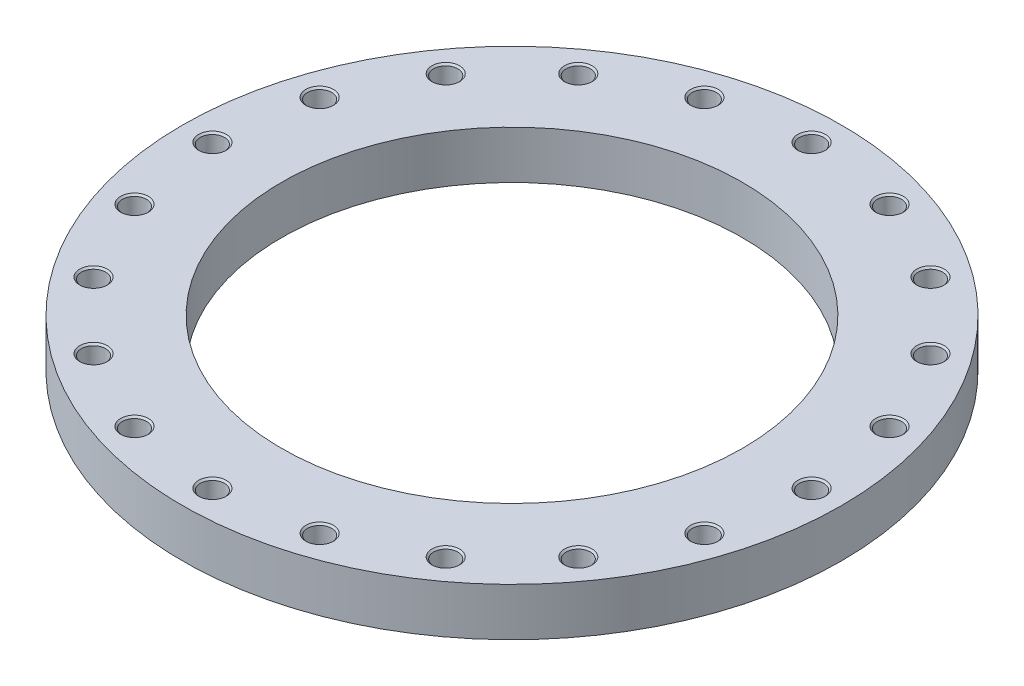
ISO-10303-21;
HEADER;
FILE_DESCRIPTION(('STEP AP214'),'2;1');
FILE_NAME('part.step','',(''),(''),'','','');
FILE_SCHEMA(('AUTOMOTIVE_DESIGN { 1 0 10303 214 1 1 1 1 }'));
ENDSEC;
DATA;
#1=APPLICATION_CONTEXT('core data for automotive mechanical design processes');
#2=APPLICATION_PROTOCOL_DEFINITION('international standard','automotive_design',2000,#1);
#3=PRODUCT_CONTEXT('',#1,'mechanical');
#4=PRODUCT('Part','Part','',(#3));
#5=PRODUCT_RELATED_PRODUCT_CATEGORY('part','',(#4));
#6=PRODUCT_DEFINITION_FORMATION('','',#4);
#7=PRODUCT_DEFINITION_CONTEXT('part definition',#1,'design');
#8=PRODUCT_DEFINITION('design','',#6,#7);
#9=PRODUCT_DEFINITION_SHAPE('','',#8);
#10=(LENGTH_UNIT() NAMED_UNIT(*) SI_UNIT(.MILLI.,.METRE.));
#11=(NAMED_UNIT(*) PLANE_ANGLE_UNIT() SI_UNIT($,.RADIAN.));
#12=(NAMED_UNIT(*) SI_UNIT($,.STERADIAN.) SOLID_ANGLE_UNIT());
#13=UNCERTAINTY_MEASURE_WITH_UNIT(LENGTH_MEASURE(1.E-05),#10,'distance_accuracy_value','');
#14=(GEOMETRIC_REPRESENTATION_CONTEXT(3) GLOBAL_UNCERTAINTY_ASSIGNED_CONTEXT((#13)) GLOBAL_UNIT_ASSIGNED_CONTEXT((#10,
#11,#12)) REPRESENTATION_CONTEXT('',''));
#15=CARTESIAN_POINT('',(0.,0.,0.));
#16=DIRECTION('',(0.,0.,1.));
#17=DIRECTION('',(1.,0.,0.));
#18=AXIS2_PLACEMENT_3D('',#15,#16,#17);
#19=CARTESIAN_POINT('',(0.,26.,0.));
#20=DIRECTION('',(0.,-1.,0.));
#21=DIRECTION('',(1.,0.,0.));
#22=AXIS2_PLACEMENT_3D('',#19,#20,#21);
#23=CYLINDRICAL_SURFACE('',#22,357.5);
#24=CARTESIAN_POINT('',(0.,0.,0.));
#25=DIRECTION('',(0.,1.,0.));
#26=DIRECTION('',(1.,0.,0.));
#27=AXIS2_PLACEMENT_3D('',#24,#25,#26);
#28=CIRCLE('',#27,357.5);
#29=CARTESIAN_POINT('',(357.5,0.,0.));
#30=VERTEX_POINT('',#29);
#31=EDGE_CURVE('E9',#30,#30,#28,.T.);
#32=ORIENTED_EDGE('',*,*,#31,.T.);
#33=EDGE_LOOP('',(#32));
#34=FACE_BOUND('',#33,.T.);
#35=CARTESIAN_POINT('',(0.,52.,0.));
#36=DIRECTION('',(0.,1.,0.));
#37=DIRECTION('',(1.,0.,0.));
#38=AXIS2_PLACEMENT_3D('',#35,#36,#37);
#39=CIRCLE('',#38,357.5);
#40=CARTESIAN_POINT('',(357.5,52.,0.));
#41=VERTEX_POINT('',#40);
#42=EDGE_CURVE('E18',#41,#41,#39,.T.);
#43=ORIENTED_EDGE('',*,*,#42,.F.);
#44=EDGE_LOOP('',(#43));
#45=FACE_BOUND('',#44,.T.);
#46=ADVANCED_FACE('F15',(#34,#45),#23,.T.);
#47=CARTESIAN_POINT('',(303.75,0.,0.));
#48=DIRECTION('',(0.,-1.,0.));
#49=DIRECTION('',(-1.,0.,0.));
#50=AXIS2_PLACEMENT_3D('',#47,#48,#49);
#51=PLANE('',#50);
#52=CARTESIAN_POINT('',(0.,0.,0.));
#53=DIRECTION('',(0.,1.,0.));
#54=DIRECTION('',(1.,0.,0.));
#55=AXIS2_PLACEMENT_3D('',#52,#53,#54);
#56=CIRCLE('',#55,250.);
#57=CARTESIAN_POINT('',(250.,0.,0.));
#58=VERTEX_POINT('',#57);
#59=EDGE_CURVE('E23',#58,#58,#56,.T.);
#60=ORIENTED_EDGE('',*,*,#59,.T.);
#61=EDGE_LOOP('',(#60));
#62=FACE_BOUND('',#61,.T.);
#63=ORIENTED_EDGE('',*,*,#31,.F.);
#64=EDGE_LOOP('',(#63));
#65=FACE_BOUND('',#64,.T.);
#66=ADVANCED_FACE('F717',(#62,#65),#51,.T.);
#67=CARTESIAN_POINT('',(0.,26.,0.));
#68=DIRECTION('',(0.,-1.,0.));
#69=DIRECTION('',(1.,0.,0.));
#70=AXIS2_PLACEMENT_3D('',#67,#68,#69);
#71=CYLINDRICAL_SURFACE('',#70,250.);
#72=CARTESIAN_POINT('',(0.,52.,0.));
#73=DIRECTION('',(0.,1.,0.));
#74=DIRECTION('',(1.,0.,0.));
#75=AXIS2_PLACEMENT_3D('',#72,#73,#74);
#76=CIRCLE('',#75,250.);
#77=CARTESIAN_POINT('',(250.,52.,0.));
#78=VERTEX_POINT('',#77);
#79=EDGE_CURVE('E498',#78,#78,#76,.T.);
#80=ORIENTED_EDGE('',*,*,#79,.T.);
#81=EDGE_LOOP('',(#80));
#82=FACE_BOUND('',#81,.T.);
#83=ORIENTED_EDGE('',*,*,#59,.F.);
#84=EDGE_LOOP('',(#83));
#85=FACE_BOUND('',#84,.T.);
#86=ADVANCED_FACE('F721',(#82,#85),#71,.F.);
#87=CARTESIAN_POINT('',(303.75,52.,0.));
#88=DIRECTION('',(0.,1.,0.));
#89=DIRECTION('',(1.,0.,0.));
#90=AXIS2_PLACEMENT_3D('',#87,#88,#89);
#91=PLANE('',#90);
#92=ORIENTED_EDGE('',*,*,#42,.T.);
#93=EDGE_LOOP('',(#92));
#94=FACE_BOUND('',#93,.T.);
#95=ORIENTED_EDGE('',*,*,#79,.F.);
#96=EDGE_LOOP('',(#95));
#97=FACE_BOUND('',#96,.T.);
#98=CARTESIAN_POINT('',(325.,52.,0.));
#99=DIRECTION('',(0.,-1.,0.));
#100=DIRECTION('',(1.,0.,0.));
#101=AXIS2_PLACEMENT_3D('',#98,#99,#100);
#102=CIRCLE('',#101,15.);
#103=CARTESIAN_POINT('',(340.,52.,0.));
#104=VERTEX_POINT('',#103);
#105=EDGE_CURVE('E632',#104,#104,#102,.T.);
#106=ORIENTED_EDGE('',*,*,#105,.T.);
#107=EDGE_LOOP('',(#106));
#108=FACE_BOUND('',#107,.T.);
#109=CARTESIAN_POINT('',(309.093367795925,52.,-100.430523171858));
#110=DIRECTION('',(0.,-1.,0.));
#111=DIRECTION('',(0.951056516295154,0.,-0.309016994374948));
#112=AXIS2_PLACEMENT_3D('',#109,#110,#111);
#113=CIRCLE('',#112,15.);
#114=CARTESIAN_POINT('',(323.359215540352,52.,-105.065778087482));
#115=VERTEX_POINT('',#114);
#116=EDGE_CURVE('E482',#115,#115,#113,.T.);
#117=ORIENTED_EDGE('',*,*,#116,.T.);
#118=EDGE_LOOP('',(#117));
#119=FACE_BOUND('',#118,.T.);
#120=CARTESIAN_POINT('',(262.930523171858,52.,-191.030206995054));
#121=DIRECTION('',(0.,-1.,0.));
#122=DIRECTION('',(0.809016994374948,0.,-0.587785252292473));
#123=AXIS2_PLACEMENT_3D('',#120,#121,#122);
#124=CIRCLE('',#123,15.);
#125=CARTESIAN_POINT('',(275.065778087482,52.,-199.846985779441));
#126=VERTEX_POINT('',#125);
#127=EDGE_CURVE('E584',#126,#126,#124,.T.);
#128=ORIENTED_EDGE('',*,*,#127,.T.);
#129=EDGE_LOOP('',(#128));
#130=FACE_BOUND('',#129,.T.);
#131=CARTESIAN_POINT('',(191.030206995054,52.,-262.930523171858));
#132=DIRECTION('',(0.,-1.,0.));
#133=DIRECTION('',(0.587785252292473,0.,-0.809016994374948));
#134=AXIS2_PLACEMENT_3D('',#131,#132,#133);
#135=CIRCLE('',#134,15.);
#136=CARTESIAN_POINT('',(199.846985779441,52.,-275.065778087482));
#137=VERTEX_POINT('',#136);
#138=EDGE_CURVE('E537',#137,#137,#135,.T.);
#139=ORIENTED_EDGE('',*,*,#138,.T.);
#140=EDGE_LOOP('',(#139));
#141=FACE_BOUND('',#140,.T.);
#142=CARTESIAN_POINT('',(100.430523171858,52.,-309.093367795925));
#143=DIRECTION('',(0.,-1.,0.));
#144=DIRECTION('',(0.309016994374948,0.,-0.951056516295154));
#145=AXIS2_PLACEMENT_3D('',#142,#143,#144);
#146=CIRCLE('',#145,15.);
#147=CARTESIAN_POINT('',(105.065778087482,52.,-323.359215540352));
#148=VERTEX_POINT('',#147);
#149=EDGE_CURVE('E657',#148,#148,#146,.T.);
#150=ORIENTED_EDGE('',*,*,#149,.T.);
#151=EDGE_LOOP('',(#150));
#152=FACE_BOUND('',#151,.T.);
#153=CARTESIAN_POINT('',(0.,52.,-325.));
#154=DIRECTION('',(0.,-1.,0.));
#155=DIRECTION('',(0.,0.,-1.));
#156=AXIS2_PLACEMENT_3D('',#153,#154,#155);
#157=CIRCLE('',#156,15.);
#158=CARTESIAN_POINT('',(0.,52.,-340.));
#159=VERTEX_POINT('',#158);
#160=EDGE_CURVE('E596',#159,#159,#157,.T.);
#161=ORIENTED_EDGE('',*,*,#160,.T.);
#162=EDGE_LOOP('',(#161));
#163=FACE_BOUND('',#162,.T.);
#164=CARTESIAN_POINT('',(-100.430523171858,52.,-309.093367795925));
#165=DIRECTION('',(0.,-1.,0.));
#166=DIRECTION('',(-0.309016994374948,0.,-0.951056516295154));
#167=AXIS2_PLACEMENT_3D('',#164,#165,#166);
#168=CIRCLE('',#167,15.);
#169=CARTESIAN_POINT('',(-105.065778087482,52.,-323.359215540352));
#170=VERTEX_POINT('',#169);
#171=EDGE_CURVE('E463',#170,#170,#168,.T.);
#172=ORIENTED_EDGE('',*,*,#171,.T.);
#173=EDGE_LOOP('',(#172));
#174=FACE_BOUND('',#173,.T.);
#175=CARTESIAN_POINT('',(-191.030206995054,52.,-262.930523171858));
#176=DIRECTION('',(0.,-1.,0.));
#177=DIRECTION('',(-0.587785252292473,0.,-0.809016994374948));
#178=AXIS2_PLACEMENT_3D('',#175,#176,#177);
#179=CIRCLE('',#178,15.);
#180=CARTESIAN_POINT('',(-199.846985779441,52.,-275.065778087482));
#181=VERTEX_POINT('',#180);
#182=EDGE_CURVE('E646',#181,#181,#179,.T.);
#183=ORIENTED_EDGE('',*,*,#182,.T.);
#184=EDGE_LOOP('',(#183));
#185=FACE_BOUND('',#184,.T.);
#186=CARTESIAN_POINT('',(-262.930523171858,52.,-191.030206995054));
#187=DIRECTION('',(0.,-1.,0.));
#188=DIRECTION('',(-0.809016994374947,0.,-0.587785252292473));
#189=AXIS2_PLACEMENT_3D('',#186,#187,#188);
#190=CIRCLE('',#189,15.);
#191=CARTESIAN_POINT('',(-275.065778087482,52.,-199.846985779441));
#192=VERTEX_POINT('',#191);
#193=EDGE_CURVE('E488',#192,#192,#190,.T.);
#194=ORIENTED_EDGE('',*,*,#193,.T.);
#195=EDGE_LOOP('',(#194));
#196=FACE_BOUND('',#195,.T.);
#197=CARTESIAN_POINT('',(-309.093367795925,52.,-100.430523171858));
#198=DIRECTION('',(0.,-1.,0.));
#199=DIRECTION('',(-0.951056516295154,0.,-0.309016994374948));
#200=AXIS2_PLACEMENT_3D('',#197,#198,#199);
#201=CIRCLE('',#200,15.);
#202=CARTESIAN_POINT('',(-323.359215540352,52.,-105.065778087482));
#203=VERTEX_POINT('',#202);
#204=EDGE_CURVE('E476',#203,#203,#201,.T.);
#205=ORIENTED_EDGE('',*,*,#204,.T.);
#206=EDGE_LOOP('',(#205));
#207=FACE_BOUND('',#206,.T.);
#208=CARTESIAN_POINT('',(-325.,52.,0.));
#209=DIRECTION('',(0.,-1.,0.));
#210=DIRECTION('',(-1.,0.,0.));
#211=AXIS2_PLACEMENT_3D('',#208,#209,#210);
#212=CIRCLE('',#211,15.);
#213=CARTESIAN_POINT('',(-340.,52.,0.));
#214=VERTEX_POINT('',#213);
#215=EDGE_CURVE('E619',#214,#214,#212,.T.);
#216=ORIENTED_EDGE('',*,*,#215,.T.);
#217=EDGE_LOOP('',(#216));
#218=FACE_BOUND('',#217,.T.);
#219=CARTESIAN_POINT('',(-309.093367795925,52.,100.430523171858));
#220=DIRECTION('',(0.,-1.,0.));
#221=DIRECTION('',(-0.951056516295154,0.,0.309016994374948));
#222=AXIS2_PLACEMENT_3D('',#219,#220,#221);
#223=CIRCLE('',#222,15.);
#224=CARTESIAN_POINT('',(-323.359215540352,52.,105.065778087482));
#225=VERTEX_POINT('',#224);
#226=EDGE_CURVE('E601',#225,#225,#223,.T.);
#227=ORIENTED_EDGE('',*,*,#226,.T.);
#228=EDGE_LOOP('',(#227));
#229=FACE_BOUND('',#228,.T.);
#230=CARTESIAN_POINT('',(-262.930523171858,52.,191.030206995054));
#231=DIRECTION('',(0.,-1.,0.));
#232=DIRECTION('',(-0.809016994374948,0.,0.587785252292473));
#233=AXIS2_PLACEMENT_3D('',#230,#231,#232);
#234=CIRCLE('',#233,15.);
#235=CARTESIAN_POINT('',(-275.065778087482,52.,199.846985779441));
#236=VERTEX_POINT('',#235);
#237=EDGE_CURVE('E583',#236,#236,#234,.T.);
#238=ORIENTED_EDGE('',*,*,#237,.T.);
#239=EDGE_LOOP('',(#238));
#240=FACE_BOUND('',#239,.T.);
#241=CARTESIAN_POINT('',(-191.030206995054,52.,262.930523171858));
#242=DIRECTION('',(0.,-1.,0.));
#243=DIRECTION('',(-0.587785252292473,0.,0.809016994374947));
#244=AXIS2_PLACEMENT_3D('',#241,#242,#243);
#245=CIRCLE('',#244,15.);
#246=CARTESIAN_POINT('',(-199.846985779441,52.,275.065778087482));
#247=VERTEX_POINT('',#246);
#248=EDGE_CURVE('E500',#247,#247,#245,.T.);
#249=ORIENTED_EDGE('',*,*,#248,.T.);
#250=EDGE_LOOP('',(#249));
#251=FACE_BOUND('',#250,.T.);
#252=CARTESIAN_POINT('',(-100.430523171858,52.,309.093367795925));
#253=DIRECTION('',(0.,-1.,0.));
#254=DIRECTION('',(-0.309016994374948,0.,0.951056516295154));
#255=AXIS2_PLACEMENT_3D('',#252,#253,#254);
#256=CIRCLE('',#255,15.);
#257=CARTESIAN_POINT('',(-105.065778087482,52.,323.359215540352));
#258=VERTEX_POINT('',#257);
#259=EDGE_CURVE('E514',#258,#258,#256,.T.);
#260=ORIENTED_EDGE('',*,*,#259,.T.);
#261=EDGE_LOOP('',(#260));
#262=FACE_BOUND('',#261,.T.);
#263=CARTESIAN_POINT('',(0.,52.,325.));
#264=DIRECTION('',(0.,-1.,0.));
#265=DIRECTION('',(0.,0.,1.));
#266=AXIS2_PLACEMENT_3D('',#263,#264,#265);
#267=CIRCLE('',#266,15.);
#268=CARTESIAN_POINT('',(0.,52.,340.));
#269=VERTEX_POINT('',#268);
#270=EDGE_CURVE('E534',#269,#269,#267,.T.);
#271=ORIENTED_EDGE('',*,*,#270,.T.);
#272=EDGE_LOOP('',(#271));
#273=FACE_BOUND('',#272,.T.);
#274=CARTESIAN_POINT('',(100.430523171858,52.,309.093367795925));
#275=DIRECTION('',(0.,-1.,0.));
#276=DIRECTION('',(0.309016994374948,0.,0.951056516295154));
#277=AXIS2_PLACEMENT_3D('',#274,#275,#276);
#278=CIRCLE('',#277,15.);
#279=CARTESIAN_POINT('',(105.065778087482,52.,323.359215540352));
#280=VERTEX_POINT('',#279);
#281=EDGE_CURVE('E511',#280,#280,#278,.T.);
#282=ORIENTED_EDGE('',*,*,#281,.T.);
#283=EDGE_LOOP('',(#282));
#284=FACE_BOUND('',#283,.T.);
#285=CARTESIAN_POINT('',(191.030206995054,52.,262.930523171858));
#286=DIRECTION('',(0.,-1.,0.));
#287=DIRECTION('',(0.587785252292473,0.,0.809016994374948));
#288=AXIS2_PLACEMENT_3D('',#285,#286,#287);
#289=CIRCLE('',#288,15.);
#290=CARTESIAN_POINT('',(199.846985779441,52.,275.065778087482));
#291=VERTEX_POINT('',#290);
#292=EDGE_CURVE('E487',#291,#291,#289,.T.);
#293=ORIENTED_EDGE('',*,*,#292,.T.);
#294=EDGE_LOOP('',(#293));
#295=FACE_BOUND('',#294,.T.);
#296=CARTESIAN_POINT('',(262.930523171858,52.,191.030206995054));
#297=DIRECTION('',(0.,-1.,0.));
#298=DIRECTION('',(0.809016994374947,0.,0.587785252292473));
#299=AXIS2_PLACEMENT_3D('',#296,#297,#298);
#300=CIRCLE('',#299,15.);
#301=CARTESIAN_POINT('',(275.065778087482,52.,199.846985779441));
#302=VERTEX_POINT('',#301);
#303=EDGE_CURVE('E771',#302,#302,#300,.T.);
#304=ORIENTED_EDGE('',*,*,#303,.T.);
#305=EDGE_LOOP('',(#304));
#306=FACE_BOUND('',#305,.T.);
#307=CARTESIAN_POINT('',(309.093367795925,52.,100.430523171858));
#308=DIRECTION('',(0.,-1.,0.));
#309=DIRECTION('',(0.951056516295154,0.,0.309016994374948));
#310=AXIS2_PLACEMENT_3D('',#307,#308,#309);
#311=CIRCLE('',#310,15.);
#312=CARTESIAN_POINT('',(323.359215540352,52.,105.065778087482));
#313=VERTEX_POINT('',#312);
#314=EDGE_CURVE('E773',#313,#313,#311,.T.);
#315=ORIENTED_EDGE('',*,*,#314,.T.);
#316=EDGE_LOOP('',(#315));
#317=FACE_BOUND('',#316,.T.);
#318=ADVANCED_FACE('F726',(#94,#97,#108,#119,#130,#141,#152,#163,#174,#185,#196,#207,#218,#229,
#240,#251,#262,#273,#284,#295,#306,#317),#91,.T.);
#319=CARTESIAN_POINT('',(325.,8.21673193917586,0.));
#320=DIRECTION('',(0.,1.,0.));
#321=DIRECTION('',(1.,0.,0.));
#322=AXIS2_PLACEMENT_3D('',#319,#320,#321);
#323=CONICAL_SURFACE('',#322,6.5528125,1.0471975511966);
#324=CARTESIAN_POINT('',(325.,12.,0.));
#325=DIRECTION('',(0.,-1.,0.));
#326=DIRECTION('',(1.,0.,0.));
#327=AXIS2_PLACEMENT_3D('',#324,#325,#326);
#328=CIRCLE('',#327,13.105625);
#329=CARTESIAN_POINT('',(338.105625,12.,0.));
#330=VERTEX_POINT('',#329);
#331=EDGE_CURVE('E496',#330,#330,#328,.T.);
#332=ORIENTED_EDGE('',*,*,#331,.F.);
#333=EDGE_LOOP('',(#332));
#334=FACE_BOUND('',#333,.T.);
#335=CARTESIAN_POINT('',(325.,4.43346387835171,0.));
#336=VERTEX_POINT('',#335);
#337=VERTEX_LOOP('',#336);
#338=FACE_BOUND('',#337,.T.);
#339=ADVANCED_FACE('F729',(#334,#338),#323,.F.);
#340=CARTESIAN_POINT('',(325.,16.0528125,0.));
#341=DIRECTION('',(0.,1.,0.));
#342=DIRECTION('',(1.,0.,0.));
#343=AXIS2_PLACEMENT_3D('',#340,#341,#342);
#344=CYLINDRICAL_SURFACE('',#343,13.105625);
#345=CARTESIAN_POINT('',(325.,20.105625,0.));
#346=DIRECTION('',(0.,-1.,0.));
#347=DIRECTION('',(1.,0.,0.));
#348=AXIS2_PLACEMENT_3D('',#345,#346,#347);
#349=CIRCLE('',#348,13.105625);
#350=CARTESIAN_POINT('',(338.105625,20.105625,0.));
#351=VERTEX_POINT('',#350);
#352=EDGE_CURVE('E499',#351,#351,#349,.T.);
#353=ORIENTED_EDGE('',*,*,#352,.F.);
#354=EDGE_LOOP('',(#353));
#355=FACE_BOUND('',#354,.T.);
#356=ORIENTED_EDGE('',*,*,#331,.T.);
#357=EDGE_LOOP('',(#356));
#358=FACE_BOUND('',#357,.T.);
#359=ADVANCED_FACE('F849',(#355,#358),#344,.F.);
#360=CARTESIAN_POINT('',(325.,21.0528125,0.));
#361=DIRECTION('',(0.,1.,0.));
#362=DIRECTION('',(1.,0.,0.));
#363=AXIS2_PLACEMENT_3D('',#360,#361,#362);
#364=CONICAL_SURFACE('',#363,14.0528125,0.785398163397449);
#365=CARTESIAN_POINT('',(325.,22.,0.));
#366=DIRECTION('',(0.,-1.,0.));
#367=DIRECTION('',(1.,0.,0.));
#368=AXIS2_PLACEMENT_3D('',#365,#366,#367);
#369=CIRCLE('',#368,15.);
#370=CARTESIAN_POINT('',(340.,22.,0.));
#371=VERTEX_POINT('',#370);
#372=EDGE_CURVE('E652',#371,#371,#369,.T.);
#373=ORIENTED_EDGE('',*,*,#372,.F.);
#374=EDGE_LOOP('',(#373));
#375=FACE_BOUND('',#374,.T.);
#376=ORIENTED_EDGE('',*,*,#352,.T.);
#377=EDGE_LOOP('',(#376));
#378=FACE_BOUND('',#377,.T.);
#379=ADVANCED_FACE('F845',(#375,#378),#364,.F.);
#380=CARTESIAN_POINT('',(339.0528125,22.,0.));
#381=DIRECTION('',(0.,1.,0.));
#382=DIRECTION('',(-1.,0.,0.));
#383=AXIS2_PLACEMENT_3D('',#380,#381,#382);
#384=PLANE('',#383);
#385=CARTESIAN_POINT('',(325.,22.,0.));
#386=DIRECTION('',(0.,-1.,0.));
#387=DIRECTION('',(1.,0.,0.));
#388=AXIS2_PLACEMENT_3D('',#385,#386,#387);
#389=CIRCLE('',#388,13.105625);
#390=CARTESIAN_POINT('',(338.105625,22.,0.));
#391=VERTEX_POINT('',#390);
#392=EDGE_CURVE('E634',#391,#391,#389,.T.);
#393=ORIENTED_EDGE('',*,*,#392,.F.);
#394=EDGE_LOOP('',(#393));
#395=FACE_BOUND('',#394,.T.);
#396=ORIENTED_EDGE('',*,*,#372,.T.);
#397=EDGE_LOOP('',(#396));
#398=FACE_BOUND('',#397,.T.);
#399=ADVANCED_FACE('F848',(#395,#398),#384,.F.);
#400=CARTESIAN_POINT('',(325.,36.0528125,0.));
#401=DIRECTION('',(0.,1.,0.));
#402=DIRECTION('',(1.,0.,0.));
#403=AXIS2_PLACEMENT_3D('',#400,#401,#402);
#404=CYLINDRICAL_SURFACE('',#403,13.105625);
#405=CARTESIAN_POINT('',(325.,50.105625,0.));
#406=DIRECTION('',(0.,-1.,0.));
#407=DIRECTION('',(1.,0.,0.));
#408=AXIS2_PLACEMENT_3D('',#405,#406,#407);
#409=CIRCLE('',#408,13.105625);
#410=CARTESIAN_POINT('',(338.105625,50.105625,0.));
#411=VERTEX_POINT('',#410);
#412=EDGE_CURVE('E508',#411,#411,#409,.T.);
#413=ORIENTED_EDGE('',*,*,#412,.F.);
#414=EDGE_LOOP('',(#413));
#415=FACE_BOUND('',#414,.T.);
#416=ORIENTED_EDGE('',*,*,#392,.T.);
#417=EDGE_LOOP('',(#416));
#418=FACE_BOUND('',#417,.T.);
#419=ADVANCED_FACE('F909',(#415,#418),#404,.F.);
#420=CARTESIAN_POINT('',(325.,51.0528125,0.));
#421=DIRECTION('',(0.,1.,0.));
#422=DIRECTION('',(1.,0.,0.));
#423=AXIS2_PLACEMENT_3D('',#420,#421,#422);
#424=CONICAL_SURFACE('',#423,14.0528125,0.785398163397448);
#425=ORIENTED_EDGE('',*,*,#105,.F.);
#426=EDGE_LOOP('',(#425));
#427=FACE_BOUND('',#426,.T.);
#428=ORIENTED_EDGE('',*,*,#412,.T.);
#429=EDGE_LOOP('',(#428));
#430=FACE_BOUND('',#429,.T.);
#431=ADVANCED_FACE('F905',(#427,#430),#424,.F.);
#432=CARTESIAN_POINT('',(309.093367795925,8.21673193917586,-100.430523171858));
#433=DIRECTION('',(0.,1.,0.));
#434=DIRECTION('',(0.951056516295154,0.,-0.309016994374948));
#435=AXIS2_PLACEMENT_3D('',#432,#433,#434);
#436=CONICAL_SURFACE('',#435,6.5528125,1.0471975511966);
#437=CARTESIAN_POINT('',(309.093367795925,12.,-100.430523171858));
#438=DIRECTION('',(0.,-1.,0.));
#439=DIRECTION('',(0.951056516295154,0.,-0.309016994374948));
#440=AXIS2_PLACEMENT_3D('',#437,#438,#439);
#441=CIRCLE('',#440,13.105625);
#442=CARTESIAN_POINT('',(321.557557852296,12.,-104.480384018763));
#443=VERTEX_POINT('',#442);
#444=EDGE_CURVE('E506',#443,#443,#441,.T.);
#445=ORIENTED_EDGE('',*,*,#444,.F.);
#446=EDGE_LOOP('',(#445));
#447=FACE_BOUND('',#446,.T.);
#448=CARTESIAN_POINT('',(309.093367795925,4.43346387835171,-100.430523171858));
#449=VERTEX_POINT('',#448);
#450=VERTEX_LOOP('',#449);
#451=FACE_BOUND('',#450,.T.);
#452=ADVANCED_FACE('F908',(#447,#451),#436,.F.);
#453=CARTESIAN_POINT('',(309.093367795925,16.0528125,-100.430523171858));
#454=DIRECTION('',(0.,1.,0.));
#455=DIRECTION('',(0.951056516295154,0.,-0.309016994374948));
#456=AXIS2_PLACEMENT_3D('',#453,#454,#455);
#457=CYLINDRICAL_SURFACE('',#456,13.105625);
#458=CARTESIAN_POINT('',(309.093367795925,20.105625,-100.430523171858));
#459=DIRECTION('',(0.,-1.,0.));
#460=DIRECTION('',(0.951056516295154,0.,-0.309016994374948));
#461=AXIS2_PLACEMENT_3D('',#458,#459,#460);
#462=CIRCLE('',#461,13.105625);
#463=CARTESIAN_POINT('',(321.557557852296,20.105625,-104.480384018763));
#464=VERTEX_POINT('',#463);
#465=EDGE_CURVE('E509',#464,#464,#462,.T.);
#466=ORIENTED_EDGE('',*,*,#465,.F.);
#467=EDGE_LOOP('',(#466));
#468=FACE_BOUND('',#467,.T.);
#469=ORIENTED_EDGE('',*,*,#444,.T.);
#470=EDGE_LOOP('',(#469));
#471=FACE_BOUND('',#470,.T.);
#472=ADVANCED_FACE('F1139',(#468,#471),#457,.F.);
#473=CARTESIAN_POINT('',(309.093367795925,21.0528125,-100.430523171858));
#474=DIRECTION('',(0.,1.,0.));
#475=DIRECTION('',(0.951056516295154,0.,-0.309016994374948));
#476=AXIS2_PLACEMENT_3D('',#473,#474,#475);
#477=CONICAL_SURFACE('',#476,14.0528125,0.785398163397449);
#478=CARTESIAN_POINT('',(309.093367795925,22.,-100.430523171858));
#479=DIRECTION('',(0.,-1.,0.));
#480=DIRECTION('',(0.951056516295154,0.,-0.309016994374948));
#481=AXIS2_PLACEMENT_3D('',#478,#479,#480);
#482=CIRCLE('',#481,15.);
#483=CARTESIAN_POINT('',(323.359215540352,22.,-105.065778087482));
#484=VERTEX_POINT('',#483);
#485=EDGE_CURVE('E671',#484,#484,#482,.T.);
#486=ORIENTED_EDGE('',*,*,#485,.F.);
#487=EDGE_LOOP('',(#486));
#488=FACE_BOUND('',#487,.T.);
#489=ORIENTED_EDGE('',*,*,#465,.T.);
#490=EDGE_LOOP('',(#489));
#491=FACE_BOUND('',#490,.T.);
#492=ADVANCED_FACE('F1144',(#488,#491),#477,.F.);
#493=CARTESIAN_POINT('',(322.458386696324,22.,-104.773081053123));
#494=DIRECTION('',(0.,1.,0.));
#495=DIRECTION('',(-0.951056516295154,0.,0.309016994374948));
#496=AXIS2_PLACEMENT_3D('',#493,#494,#495);
#497=PLANE('',#496);
#498=CARTESIAN_POINT('',(309.093367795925,22.,-100.430523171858));
#499=DIRECTION('',(0.,-1.,0.));
#500=DIRECTION('',(0.951056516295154,0.,-0.309016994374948));
#501=AXIS2_PLACEMENT_3D('',#498,#499,#500);
#502=CIRCLE('',#501,13.105625);
#503=CARTESIAN_POINT('',(321.557557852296,22.,-104.480384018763));
#504=VERTEX_POINT('',#503);
#505=EDGE_CURVE('E577',#504,#504,#502,.T.);
#506=ORIENTED_EDGE('',*,*,#505,.F.);
#507=EDGE_LOOP('',(#506));
#508=FACE_BOUND('',#507,.T.);
#509=ORIENTED_EDGE('',*,*,#485,.T.);
#510=EDGE_LOOP('',(#509));
#511=FACE_BOUND('',#510,.T.);
#512=ADVANCED_FACE('F950',(#508,#511),#497,.F.);
#513=CARTESIAN_POINT('',(309.093367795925,36.0528125,-100.430523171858));
#514=DIRECTION('',(0.,1.,0.));
#515=DIRECTION('',(0.951056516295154,0.,-0.309016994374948));
#516=AXIS2_PLACEMENT_3D('',#513,#514,#515);
#517=CYLINDRICAL_SURFACE('',#516,13.105625);
#518=CARTESIAN_POINT('',(309.093367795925,50.105625,-100.430523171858));
#519=DIRECTION('',(0.,-1.,0.));
#520=DIRECTION('',(0.951056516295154,0.,-0.309016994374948));
#521=AXIS2_PLACEMENT_3D('',#518,#519,#520);
#522=CIRCLE('',#521,13.105625);
#523=CARTESIAN_POINT('',(321.557557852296,50.105625,-104.480384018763));
#524=VERTEX_POINT('',#523);
#525=EDGE_CURVE('E480',#524,#524,#522,.T.);
#526=ORIENTED_EDGE('',*,*,#525,.F.);
#527=EDGE_LOOP('',(#526));
#528=FACE_BOUND('',#527,.T.);
#529=ORIENTED_EDGE('',*,*,#505,.T.);
#530=EDGE_LOOP('',(#529));
#531=FACE_BOUND('',#530,.T.);
#532=ADVANCED_FACE('F946',(#528,#531),#517,.F.);
#533=CARTESIAN_POINT('',(309.093367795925,51.0528125,-100.430523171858));
#534=DIRECTION('',(0.,1.,0.));
#535=DIRECTION('',(0.951056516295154,0.,-0.309016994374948));
#536=AXIS2_PLACEMENT_3D('',#533,#534,#535);
#537=CONICAL_SURFACE('',#536,14.0528125,0.785398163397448);
#538=ORIENTED_EDGE('',*,*,#116,.F.);
#539=EDGE_LOOP('',(#538));
#540=FACE_BOUND('',#539,.T.);
#541=ORIENTED_EDGE('',*,*,#525,.T.);
#542=EDGE_LOOP('',(#541));
#543=FACE_BOUND('',#542,.T.);
#544=ADVANCED_FACE('F949',(#540,#543),#537,.F.);
#545=CARTESIAN_POINT('',(262.930523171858,8.21673193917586,-191.030206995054));
#546=DIRECTION('',(0.,1.,0.));
#547=DIRECTION('',(0.809016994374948,0.,-0.587785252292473));
#548=AXIS2_PLACEMENT_3D('',#545,#546,#547);
#549=CONICAL_SURFACE('',#548,6.5528125,1.0471975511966);
#550=CARTESIAN_POINT('',(262.930523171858,12.,-191.030206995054));
#551=DIRECTION('',(0.,-1.,0.));
#552=DIRECTION('',(0.809016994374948,0.,-0.587785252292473));
#553=AXIS2_PLACEMENT_3D('',#550,#551,#552);
#554=CIRCLE('',#553,13.105625);
#555=CARTESIAN_POINT('',(273.533196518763,12.,-198.73350009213));
#556=VERTEX_POINT('',#555);
#557=EDGE_CURVE('E483',#556,#556,#554,.T.);
#558=ORIENTED_EDGE('',*,*,#557,.F.);
#559=EDGE_LOOP('',(#558));
#560=FACE_BOUND('',#559,.T.);
#561=CARTESIAN_POINT('',(262.930523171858,4.43346387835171,-191.030206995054));
#562=VERTEX_POINT('',#561);
#563=VERTEX_LOOP('',#562);
#564=FACE_BOUND('',#563,.T.);
#565=ADVANCED_FACE('F859',(#560,#564),#549,.F.);
#566=CARTESIAN_POINT('',(262.930523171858,16.0528125,-191.030206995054));
#567=DIRECTION('',(0.,1.,0.));
#568=DIRECTION('',(0.809016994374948,0.,-0.587785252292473));
#569=AXIS2_PLACEMENT_3D('',#566,#567,#568);
#570=CYLINDRICAL_SURFACE('',#569,13.105625);
#571=CARTESIAN_POINT('',(262.930523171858,20.105625,-191.030206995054));
#572=DIRECTION('',(0.,-1.,0.));
#573=DIRECTION('',(0.809016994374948,0.,-0.587785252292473));
#574=AXIS2_PLACEMENT_3D('',#571,#572,#573);
#575=CIRCLE('',#574,13.105625);
#576=CARTESIAN_POINT('',(273.533196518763,20.105625,-198.73350009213));
#577=VERTEX_POINT('',#576);
#578=EDGE_CURVE('E623',#577,#577,#575,.T.);
#579=ORIENTED_EDGE('',*,*,#578,.F.);
#580=EDGE_LOOP('',(#579));
#581=FACE_BOUND('',#580,.T.);
#582=ORIENTED_EDGE('',*,*,#557,.T.);
#583=EDGE_LOOP('',(#582));
#584=FACE_BOUND('',#583,.T.);
#585=ADVANCED_FACE('F855',(#581,#584),#570,.F.);
#586=CARTESIAN_POINT('',(262.930523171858,21.0528125,-191.030206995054));
#587=DIRECTION('',(0.,1.,0.));
#588=DIRECTION('',(0.809016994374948,0.,-0.587785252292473));
#589=AXIS2_PLACEMENT_3D('',#586,#587,#588);
#590=CONICAL_SURFACE('',#589,14.0528125,0.785398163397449);
#591=CARTESIAN_POINT('',(262.930523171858,22.,-191.030206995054));
#592=DIRECTION('',(0.,-1.,0.));
#593=DIRECTION('',(0.809016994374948,0.,-0.587785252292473));
#594=AXIS2_PLACEMENT_3D('',#591,#592,#593);
#595=CIRCLE('',#594,15.);
#596=CARTESIAN_POINT('',(275.065778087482,22.,-199.846985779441));
#597=VERTEX_POINT('',#596);
#598=EDGE_CURVE('E625',#597,#597,#595,.T.);
#599=ORIENTED_EDGE('',*,*,#598,.F.);
#600=EDGE_LOOP('',(#599));
#601=FACE_BOUND('',#600,.T.);
#602=ORIENTED_EDGE('',*,*,#578,.T.);
#603=EDGE_LOOP('',(#602));
#604=FACE_BOUND('',#603,.T.);
#605=ADVANCED_FACE('F858',(#601,#604),#590,.F.);
#606=CARTESIAN_POINT('',(274.299487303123,22.,-199.290242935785));
#607=DIRECTION('',(0.,1.,0.));
#608=DIRECTION('',(-0.809016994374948,0.,0.587785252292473));
#609=AXIS2_PLACEMENT_3D('',#606,#607,#608);
#610=PLANE('',#609);
#611=CARTESIAN_POINT('',(262.930523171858,22.,-191.030206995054));
#612=DIRECTION('',(0.,-1.,0.));
#613=DIRECTION('',(0.809016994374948,0.,-0.587785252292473));
#614=AXIS2_PLACEMENT_3D('',#611,#612,#613);
#615=CIRCLE('',#614,13.105625);
#616=CARTESIAN_POINT('',(273.533196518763,22.,-198.73350009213));
#617=VERTEX_POINT('',#616);
#618=EDGE_CURVE('E586',#617,#617,#615,.T.);
#619=ORIENTED_EDGE('',*,*,#618,.F.);
#620=EDGE_LOOP('',(#619));
#621=FACE_BOUND('',#620,.T.);
#622=ORIENTED_EDGE('',*,*,#598,.T.);
#623=EDGE_LOOP('',(#622));
#624=FACE_BOUND('',#623,.T.);
#625=ADVANCED_FACE('F1095',(#621,#624),#610,.F.);
#626=CARTESIAN_POINT('',(262.930523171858,36.0528125,-191.030206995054));
#627=DIRECTION('',(0.,1.,0.));
#628=DIRECTION('',(0.809016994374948,0.,-0.587785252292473));
#629=AXIS2_PLACEMENT_3D('',#626,#627,#628);
#630=CYLINDRICAL_SURFACE('',#629,13.105625);
#631=CARTESIAN_POINT('',(262.930523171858,50.105625,-191.030206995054));
#632=DIRECTION('',(0.,-1.,0.));
#633=DIRECTION('',(0.809016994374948,0.,-0.587785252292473));
#634=AXIS2_PLACEMENT_3D('',#631,#632,#633);
#635=CIRCLE('',#634,13.105625);
#636=CARTESIAN_POINT('',(273.533196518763,50.105625,-198.73350009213));
#637=VERTEX_POINT('',#636);
#638=EDGE_CURVE('E558',#637,#637,#635,.T.);
#639=ORIENTED_EDGE('',*,*,#638,.F.);
#640=EDGE_LOOP('',(#639));
#641=FACE_BOUND('',#640,.T.);
#642=ORIENTED_EDGE('',*,*,#618,.T.);
#643=EDGE_LOOP('',(#642));
#644=FACE_BOUND('',#643,.T.);
#645=ADVANCED_FACE('F933',(#641,#644),#630,.F.);
#646=CARTESIAN_POINT('',(262.930523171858,51.0528125,-191.030206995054));
#647=DIRECTION('',(0.,1.,0.));
#648=DIRECTION('',(0.809016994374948,0.,-0.587785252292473));
#649=AXIS2_PLACEMENT_3D('',#646,#647,#648);
#650=CONICAL_SURFACE('',#649,14.0528125,0.785398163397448);
#651=ORIENTED_EDGE('',*,*,#127,.F.);
#652=EDGE_LOOP('',(#651));
#653=FACE_BOUND('',#652,.T.);
#654=ORIENTED_EDGE('',*,*,#638,.T.);
#655=EDGE_LOOP('',(#654));
#656=FACE_BOUND('',#655,.T.);
#657=ADVANCED_FACE('F929',(#653,#656),#650,.F.);
#658=CARTESIAN_POINT('',(191.030206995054,8.21673193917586,-262.930523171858));
#659=DIRECTION('',(0.,1.,0.));
#660=DIRECTION('',(0.587785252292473,0.,-0.809016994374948));
#661=AXIS2_PLACEMENT_3D('',#658,#659,#660);
#662=CONICAL_SURFACE('',#661,6.5528125,1.0471975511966);
#663=CARTESIAN_POINT('',(191.030206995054,12.,-262.930523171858));
#664=DIRECTION('',(0.,-1.,0.));
#665=DIRECTION('',(0.587785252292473,0.,-0.809016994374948));
#666=AXIS2_PLACEMENT_3D('',#663,#664,#665);
#667=CIRCLE('',#666,13.105625);
#668=CARTESIAN_POINT('',(198.73350009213,12.,-273.533196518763));
#669=VERTEX_POINT('',#668);
#670=EDGE_CURVE('E556',#669,#669,#667,.T.);
#671=ORIENTED_EDGE('',*,*,#670,.F.);
#672=EDGE_LOOP('',(#671));
#673=FACE_BOUND('',#672,.T.);
#674=CARTESIAN_POINT('',(191.030206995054,4.43346387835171,-262.930523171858));
#675=VERTEX_POINT('',#674);
#676=VERTEX_LOOP('',#675);
#677=FACE_BOUND('',#676,.T.);
#678=ADVANCED_FACE('F932',(#673,#677),#662,.F.);
#679=CARTESIAN_POINT('',(191.030206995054,16.0528125,-262.930523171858));
#680=DIRECTION('',(0.,1.,0.));
#681=DIRECTION('',(0.587785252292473,0.,-0.809016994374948));
#682=AXIS2_PLACEMENT_3D('',#679,#680,#681);
#683=CYLINDRICAL_SURFACE('',#682,13.105625);
#684=CARTESIAN_POINT('',(191.030206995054,20.105625,-262.930523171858));
#685=DIRECTION('',(0.,-1.,0.));
#686=DIRECTION('',(0.587785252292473,0.,-0.809016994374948));
#687=AXIS2_PLACEMENT_3D('',#684,#685,#686);
#688=CIRCLE('',#687,13.105625);
#689=CARTESIAN_POINT('',(198.73350009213,20.105625,-273.533196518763));
#690=VERTEX_POINT('',#689);
#691=EDGE_CURVE('E552',#690,#690,#688,.T.);
#692=ORIENTED_EDGE('',*,*,#691,.F.);
#693=EDGE_LOOP('',(#692));
#694=FACE_BOUND('',#693,.T.);
#695=ORIENTED_EDGE('',*,*,#670,.T.);
#696=EDGE_LOOP('',(#695));
#697=FACE_BOUND('',#696,.T.);
#698=ADVANCED_FACE('F984',(#694,#697),#683,.F.);
#699=CARTESIAN_POINT('',(191.030206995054,21.0528125,-262.930523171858));
#700=DIRECTION('',(0.,1.,0.));
#701=DIRECTION('',(0.587785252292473,0.,-0.809016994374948));
#702=AXIS2_PLACEMENT_3D('',#699,#700,#701);
#703=CONICAL_SURFACE('',#702,14.0528125,0.785398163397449);
#704=CARTESIAN_POINT('',(191.030206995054,22.,-262.930523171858));
#705=DIRECTION('',(0.,-1.,0.));
#706=DIRECTION('',(0.587785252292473,0.,-0.809016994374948));
#707=AXIS2_PLACEMENT_3D('',#704,#705,#706);
#708=CIRCLE('',#707,15.);
#709=CARTESIAN_POINT('',(199.846985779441,22.,-275.065778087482));
#710=VERTEX_POINT('',#709);
#711=EDGE_CURVE('E550',#710,#710,#708,.T.);
#712=ORIENTED_EDGE('',*,*,#711,.F.);
#713=EDGE_LOOP('',(#712));
#714=FACE_BOUND('',#713,.T.);
#715=ORIENTED_EDGE('',*,*,#691,.T.);
#716=EDGE_LOOP('',(#715));
#717=FACE_BOUND('',#716,.T.);
#718=ADVANCED_FACE('F980',(#714,#717),#703,.F.);
#719=CARTESIAN_POINT('',(199.290242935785,22.,-274.299487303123));
#720=DIRECTION('',(0.,1.,0.));
#721=DIRECTION('',(-0.587785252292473,0.,0.809016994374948));
#722=AXIS2_PLACEMENT_3D('',#719,#720,#721);
#723=PLANE('',#722);
#724=CARTESIAN_POINT('',(191.030206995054,22.,-262.930523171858));
#725=DIRECTION('',(0.,-1.,0.));
#726=DIRECTION('',(0.587785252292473,0.,-0.809016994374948));
#727=AXIS2_PLACEMENT_3D('',#724,#725,#726);
#728=CIRCLE('',#727,13.105625);
#729=CARTESIAN_POINT('',(198.73350009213,22.,-273.533196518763));
#730=VERTEX_POINT('',#729);
#731=EDGE_CURVE('E539',#730,#730,#728,.T.);
#732=ORIENTED_EDGE('',*,*,#731,.F.);
#733=EDGE_LOOP('',(#732));
#734=FACE_BOUND('',#733,.T.);
#735=ORIENTED_EDGE('',*,*,#711,.T.);
#736=EDGE_LOOP('',(#735));
#737=FACE_BOUND('',#736,.T.);
#738=ADVANCED_FACE('F983',(#734,#737),#723,.F.);
#739=CARTESIAN_POINT('',(191.030206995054,36.0528125,-262.930523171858));
#740=DIRECTION('',(0.,1.,0.));
#741=DIRECTION('',(0.587785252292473,0.,-0.809016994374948));
#742=AXIS2_PLACEMENT_3D('',#739,#740,#741);
#743=CYLINDRICAL_SURFACE('',#742,13.105625);
#744=CARTESIAN_POINT('',(191.030206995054,50.105625,-262.930523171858));
#745=DIRECTION('',(0.,-1.,0.));
#746=DIRECTION('',(0.587785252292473,0.,-0.809016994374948));
#747=AXIS2_PLACEMENT_3D('',#744,#745,#746);
#748=CIRCLE('',#747,13.105625);
#749=CARTESIAN_POINT('',(198.73350009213,50.105625,-273.533196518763));
#750=VERTEX_POINT('',#749);
#751=EDGE_CURVE('E540',#750,#750,#748,.T.);
#752=ORIENTED_EDGE('',*,*,#751,.F.);
#753=EDGE_LOOP('',(#752));
#754=FACE_BOUND('',#753,.T.);
#755=ORIENTED_EDGE('',*,*,#731,.T.);
#756=EDGE_LOOP('',(#755));
#757=FACE_BOUND('',#756,.T.);
#758=ADVANCED_FACE('F1309',(#754,#757),#743,.F.);
#759=CARTESIAN_POINT('',(191.030206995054,51.0528125,-262.930523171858));
#760=DIRECTION('',(0.,1.,0.));
#761=DIRECTION('',(0.587785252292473,0.,-0.809016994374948));
#762=AXIS2_PLACEMENT_3D('',#759,#760,#761);
#763=CONICAL_SURFACE('',#762,14.0528125,0.785398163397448);
#764=ORIENTED_EDGE('',*,*,#138,.F.);
#765=EDGE_LOOP('',(#764));
#766=FACE_BOUND('',#765,.T.);
#767=ORIENTED_EDGE('',*,*,#751,.T.);
#768=EDGE_LOOP('',(#767));
#769=FACE_BOUND('',#768,.T.);
#770=ADVANCED_FACE('F830',(#766,#769),#763,.F.);
#771=CARTESIAN_POINT('',(100.430523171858,8.21673193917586,-309.093367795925));
#772=DIRECTION('',(0.,1.,0.));
#773=DIRECTION('',(0.309016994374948,0.,-0.951056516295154));
#774=AXIS2_PLACEMENT_3D('',#771,#772,#773);
#775=CONICAL_SURFACE('',#774,6.5528125,1.0471975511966);
#776=CARTESIAN_POINT('',(100.430523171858,12.,-309.093367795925));
#777=DIRECTION('',(0.,-1.,0.));
#778=DIRECTION('',(0.309016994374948,0.,-0.951056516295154));
#779=AXIS2_PLACEMENT_3D('',#776,#777,#778);
#780=CIRCLE('',#779,13.105625);
#781=CARTESIAN_POINT('',(104.480384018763,12.,-321.557557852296));
#782=VERTEX_POINT('',#781);
#783=EDGE_CURVE('E580',#782,#782,#780,.T.);
#784=ORIENTED_EDGE('',*,*,#783,.F.);
#785=EDGE_LOOP('',(#784));
#786=FACE_BOUND('',#785,.T.);
#787=CARTESIAN_POINT('',(100.430523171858,4.43346387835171,-309.093367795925));
#788=VERTEX_POINT('',#787);
#789=VERTEX_LOOP('',#788);
#790=FACE_BOUND('',#789,.T.);
#791=ADVANCED_FACE('F826',(#786,#790),#775,.F.);
#792=CARTESIAN_POINT('',(100.430523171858,16.0528125,-309.093367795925));
#793=DIRECTION('',(0.,1.,0.));
#794=DIRECTION('',(0.309016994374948,0.,-0.951056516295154));
#795=AXIS2_PLACEMENT_3D('',#792,#793,#794);
#796=CYLINDRICAL_SURFACE('',#795,13.105625);
#797=CARTESIAN_POINT('',(100.430523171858,20.105625,-309.093367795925));
#798=DIRECTION('',(0.,-1.,0.));
#799=DIRECTION('',(0.309016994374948,0.,-0.951056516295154));
#800=AXIS2_PLACEMENT_3D('',#797,#798,#799);
#801=CIRCLE('',#800,13.105625);
#802=CARTESIAN_POINT('',(104.480384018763,20.105625,-321.557557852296));
#803=VERTEX_POINT('',#802);
#804=EDGE_CURVE('E578',#803,#803,#801,.T.);
#805=ORIENTED_EDGE('',*,*,#804,.F.);
#806=EDGE_LOOP('',(#805));
#807=FACE_BOUND('',#806,.T.);
#808=ORIENTED_EDGE('',*,*,#783,.T.);
#809=EDGE_LOOP('',(#808));
#810=FACE_BOUND('',#809,.T.);
#811=ADVANCED_FACE('F829',(#807,#810),#796,.F.);
#812=CARTESIAN_POINT('',(100.430523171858,21.0528125,-309.093367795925));
#813=DIRECTION('',(0.,1.,0.));
#814=DIRECTION('',(0.309016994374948,0.,-0.951056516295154));
#815=AXIS2_PLACEMENT_3D('',#812,#813,#814);
#816=CONICAL_SURFACE('',#815,14.0528125,0.785398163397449);
#817=CARTESIAN_POINT('',(100.430523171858,22.,-309.093367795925));
#818=DIRECTION('',(0.,-1.,0.));
#819=DIRECTION('',(0.309016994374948,0.,-0.951056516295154));
#820=AXIS2_PLACEMENT_3D('',#817,#818,#819);
#821=CIRCLE('',#820,15.);
#822=CARTESIAN_POINT('',(105.065778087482,22.,-323.359215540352));
#823=VERTEX_POINT('',#822);
#824=EDGE_CURVE('E581',#823,#823,#821,.T.);
#825=ORIENTED_EDGE('',*,*,#824,.F.);
#826=EDGE_LOOP('',(#825));
#827=FACE_BOUND('',#826,.T.);
#828=ORIENTED_EDGE('',*,*,#804,.T.);
#829=EDGE_LOOP('',(#828));
#830=FACE_BOUND('',#829,.T.);
#831=ADVANCED_FACE('F900',(#827,#830),#816,.F.);
#832=CARTESIAN_POINT('',(104.773081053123,22.,-322.458386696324));
#833=DIRECTION('',(0.,1.,0.));
#834=DIRECTION('',(-0.309016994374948,0.,0.951056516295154));
#835=AXIS2_PLACEMENT_3D('',#832,#833,#834);
#836=PLANE('',#835);
#837=CARTESIAN_POINT('',(100.430523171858,22.,-309.093367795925));
#838=DIRECTION('',(0.,-1.,0.));
#839=DIRECTION('',(0.309016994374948,0.,-0.951056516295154));
#840=AXIS2_PLACEMENT_3D('',#837,#838,#839);
#841=CIRCLE('',#840,13.105625);
#842=CARTESIAN_POINT('',(104.480384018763,22.,-321.557557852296));
#843=VERTEX_POINT('',#842);
#844=EDGE_CURVE('E659',#843,#843,#841,.T.);
#845=ORIENTED_EDGE('',*,*,#844,.F.);
#846=EDGE_LOOP('',(#845));
#847=FACE_BOUND('',#846,.T.);
#848=ORIENTED_EDGE('',*,*,#824,.T.);
#849=EDGE_LOOP('',(#848));
#850=FACE_BOUND('',#849,.T.);
#851=ADVANCED_FACE('F903',(#847,#850),#836,.F.);
#852=CARTESIAN_POINT('',(100.430523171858,36.0528125,-309.093367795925));
#853=DIRECTION('',(0.,1.,0.));
#854=DIRECTION('',(0.309016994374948,0.,-0.951056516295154));
#855=AXIS2_PLACEMENT_3D('',#852,#853,#854);
#856=CYLINDRICAL_SURFACE('',#855,13.105625);
#857=CARTESIAN_POINT('',(100.430523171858,50.105625,-309.093367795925));
#858=DIRECTION('',(0.,-1.,0.));
#859=DIRECTION('',(0.309016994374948,0.,-0.951056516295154));
#860=AXIS2_PLACEMENT_3D('',#857,#858,#859);
#861=CIRCLE('',#860,13.105625);
#862=CARTESIAN_POINT('',(104.480384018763,50.105625,-321.557557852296));
#863=VERTEX_POINT('',#862);
#864=EDGE_CURVE('E655',#863,#863,#861,.T.);
#865=ORIENTED_EDGE('',*,*,#864,.F.);
#866=EDGE_LOOP('',(#865));
#867=FACE_BOUND('',#866,.T.);
#868=ORIENTED_EDGE('',*,*,#844,.T.);
#869=EDGE_LOOP('',(#868));
#870=FACE_BOUND('',#869,.T.);
#871=ADVANCED_FACE('F1107',(#867,#870),#856,.F.);
#872=CARTESIAN_POINT('',(100.430523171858,51.0528125,-309.093367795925));
#873=DIRECTION('',(0.,1.,0.));
#874=DIRECTION('',(0.309016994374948,0.,-0.951056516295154));
#875=AXIS2_PLACEMENT_3D('',#872,#873,#874);
#876=CONICAL_SURFACE('',#875,14.0528125,0.785398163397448);
#877=ORIENTED_EDGE('',*,*,#149,.F.);
#878=EDGE_LOOP('',(#877));
#879=FACE_BOUND('',#878,.T.);
#880=ORIENTED_EDGE('',*,*,#864,.T.);
#881=EDGE_LOOP('',(#880));
#882=FACE_BOUND('',#881,.T.);
#883=ADVANCED_FACE('F1110',(#879,#882),#876,.F.);
#884=CARTESIAN_POINT('',(0.,8.21673193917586,-325.));
#885=DIRECTION('',(0.,1.,0.));
#886=DIRECTION('',(0.,0.,-1.));
#887=AXIS2_PLACEMENT_3D('',#884,#885,#886);
#888=CONICAL_SURFACE('',#887,6.5528125,1.0471975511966);
#889=CARTESIAN_POINT('',(0.,12.,-325.));
#890=DIRECTION('',(0.,-1.,0.));
#891=DIRECTION('',(0.,0.,-1.));
#892=AXIS2_PLACEMENT_3D('',#889,#890,#891);
#893=CIRCLE('',#892,13.105625);
#894=CARTESIAN_POINT('',(0.,12.,-338.105625));
#895=VERTEX_POINT('',#894);
#896=EDGE_CURVE('E529',#895,#895,#893,.T.);
#897=ORIENTED_EDGE('',*,*,#896,.F.);
#898=EDGE_LOOP('',(#897));
#899=FACE_BOUND('',#898,.T.);
#900=CARTESIAN_POINT('',(0.,4.43346387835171,-325.));
#901=VERTEX_POINT('',#900);
#902=VERTEX_LOOP('',#901);
#903=FACE_BOUND('',#902,.T.);
#904=ADVANCED_FACE('F1116',(#899,#903),#888,.F.);
#905=CARTESIAN_POINT('',(0.,16.0528125,-325.));
#906=DIRECTION('',(0.,1.,0.));
#907=DIRECTION('',(0.,0.,-1.));
#908=AXIS2_PLACEMENT_3D('',#905,#906,#907);
#909=CYLINDRICAL_SURFACE('',#908,13.105625);
#910=CARTESIAN_POINT('',(0.,20.105625,-325.));
#911=DIRECTION('',(0.,-1.,0.));
#912=DIRECTION('',(0.,0.,-1.));
#913=AXIS2_PLACEMENT_3D('',#910,#911,#912);
#914=CIRCLE('',#913,13.105625);
#915=CARTESIAN_POINT('',(0.,20.105625,-338.105625));
#916=VERTEX_POINT('',#915);
#917=EDGE_CURVE('E527',#916,#916,#914,.T.);
#918=ORIENTED_EDGE('',*,*,#917,.F.);
#919=EDGE_LOOP('',(#918));
#920=FACE_BOUND('',#919,.T.);
#921=ORIENTED_EDGE('',*,*,#896,.T.);
#922=EDGE_LOOP('',(#921));
#923=FACE_BOUND('',#922,.T.);
#924=ADVANCED_FACE('F1119',(#920,#923),#909,.F.);
#925=CARTESIAN_POINT('',(0.,21.0528125,-325.));
#926=DIRECTION('',(0.,1.,0.));
#927=DIRECTION('',(0.,0.,-1.));
#928=AXIS2_PLACEMENT_3D('',#925,#926,#927);
#929=CONICAL_SURFACE('',#928,14.0528125,0.785398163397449);
#930=CARTESIAN_POINT('',(0.,22.,-325.));
#931=DIRECTION('',(0.,-1.,0.));
#932=DIRECTION('',(0.,0.,-1.));
#933=AXIS2_PLACEMENT_3D('',#930,#931,#932);
#934=CIRCLE('',#933,15.);
#935=CARTESIAN_POINT('',(0.,22.,-340.));
#936=VERTEX_POINT('',#935);
#937=EDGE_CURVE('E530',#936,#936,#934,.T.);
#938=ORIENTED_EDGE('',*,*,#937,.F.);
#939=EDGE_LOOP('',(#938));
#940=FACE_BOUND('',#939,.T.);
#941=ORIENTED_EDGE('',*,*,#917,.T.);
#942=EDGE_LOOP('',(#941));
#943=FACE_BOUND('',#942,.T.);
#944=ADVANCED_FACE('F927',(#940,#943),#929,.F.);
#945=CARTESIAN_POINT('',(0.,22.,-339.0528125));
#946=DIRECTION('',(0.,1.,0.));
#947=DIRECTION('',(0.,0.,1.));
#948=AXIS2_PLACEMENT_3D('',#945,#946,#947);
#949=PLANE('',#948);
#950=CARTESIAN_POINT('',(0.,22.,-325.));
#951=DIRECTION('',(0.,-1.,0.));
#952=DIRECTION('',(0.,0.,-1.));
#953=AXIS2_PLACEMENT_3D('',#950,#951,#952);
#954=CIRCLE('',#953,13.105625);
#955=CARTESIAN_POINT('',(0.,22.,-338.105625));
#956=VERTEX_POINT('',#955);
#957=EDGE_CURVE('E598',#956,#956,#954,.T.);
#958=ORIENTED_EDGE('',*,*,#957,.F.);
#959=EDGE_LOOP('',(#958));
#960=FACE_BOUND('',#959,.T.);
#961=ORIENTED_EDGE('',*,*,#937,.T.);
#962=EDGE_LOOP('',(#961));
#963=FACE_BOUND('',#962,.T.);
#964=ADVANCED_FACE('F924',(#960,#963),#949,.F.);
#965=CARTESIAN_POINT('',(0.,36.0528125,-325.));
#966=DIRECTION('',(0.,1.,0.));
#967=DIRECTION('',(0.,0.,-1.));
#968=AXIS2_PLACEMENT_3D('',#965,#966,#967);
#969=CYLINDRICAL_SURFACE('',#968,13.105625);
#970=CARTESIAN_POINT('',(0.,50.105625,-325.));
#971=DIRECTION('',(0.,-1.,0.));
#972=DIRECTION('',(0.,0.,-1.));
#973=AXIS2_PLACEMENT_3D('',#970,#971,#972);
#974=CIRCLE('',#973,13.105625);
#975=CARTESIAN_POINT('',(0.,50.105625,-338.105625));
#976=VERTEX_POINT('',#975);
#977=EDGE_CURVE('E599',#976,#976,#974,.T.);
#978=ORIENTED_EDGE('',*,*,#977,.F.);
#979=EDGE_LOOP('',(#978));
#980=FACE_BOUND('',#979,.T.);
#981=ORIENTED_EDGE('',*,*,#957,.T.);
#982=EDGE_LOOP('',(#981));
#983=FACE_BOUND('',#982,.T.);
#984=ADVANCED_FACE('F894',(#980,#983),#969,.F.);
#985=CARTESIAN_POINT('',(0.,51.0528125,-325.));
#986=DIRECTION('',(0.,1.,0.));
#987=DIRECTION('',(0.,0.,-1.));
#988=AXIS2_PLACEMENT_3D('',#985,#986,#987);
#989=CONICAL_SURFACE('',#988,14.0528125,0.785398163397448);
#990=ORIENTED_EDGE('',*,*,#160,.F.);
#991=EDGE_LOOP('',(#990));
#992=FACE_BOUND('',#991,.T.);
#993=ORIENTED_EDGE('',*,*,#977,.T.);
#994=EDGE_LOOP('',(#993));
#995=FACE_BOUND('',#994,.T.);
#996=ADVANCED_FACE('F890',(#992,#995),#989,.F.);
#997=CARTESIAN_POINT('',(-100.430523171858,8.21673193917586,-309.093367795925));
#998=DIRECTION('',(0.,1.,0.));
#999=DIRECTION('',(-0.309016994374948,0.,-0.951056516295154));
#1000=AXIS2_PLACEMENT_3D('',#997,#998,#999);
#1001=CONICAL_SURFACE('',#1000,6.5528125,1.0471975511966);
#1002=CARTESIAN_POINT('',(-100.430523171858,12.,-309.093367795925));
#1003=DIRECTION('',(0.,-1.,0.));
#1004=DIRECTION('',(-0.309016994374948,0.,-0.951056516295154));
#1005=AXIS2_PLACEMENT_3D('',#1002,#1003,#1004);
#1006=CIRCLE('',#1005,13.105625);
#1007=CARTESIAN_POINT('',(-104.480384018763,12.,-321.557557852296));
#1008=VERTEX_POINT('',#1007);
#1009=EDGE_CURVE('E544',#1008,#1008,#1006,.T.);
#1010=ORIENTED_EDGE('',*,*,#1009,.F.);
#1011=EDGE_LOOP('',(#1010));
#1012=FACE_BOUND('',#1011,.T.);
#1013=CARTESIAN_POINT('',(-100.430523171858,4.43346387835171,-309.093367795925));
#1014=VERTEX_POINT('',#1013);
#1015=VERTEX_LOOP('',#1014);
#1016=FACE_BOUND('',#1015,.T.);
#1017=ADVANCED_FACE('F893',(#1012,#1016),#1001,.F.);
#1018=CARTESIAN_POINT('',(-100.430523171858,16.0528125,-309.093367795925));
#1019=DIRECTION('',(0.,1.,0.));
#1020=DIRECTION('',(-0.309016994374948,0.,-0.951056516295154));
#1021=AXIS2_PLACEMENT_3D('',#1018,#1019,#1020);
#1022=CYLINDRICAL_SURFACE('',#1021,13.105625);
#1023=CARTESIAN_POINT('',(-100.430523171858,20.105625,-309.093367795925));
#1024=DIRECTION('',(0.,-1.,0.));
#1025=DIRECTION('',(-0.309016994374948,0.,-0.951056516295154));
#1026=AXIS2_PLACEMENT_3D('',#1023,#1024,#1025);
#1027=CIRCLE('',#1026,13.105625);
#1028=CARTESIAN_POINT('',(-104.480384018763,20.105625,-321.557557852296));
#1029=VERTEX_POINT('',#1028);
#1030=EDGE_CURVE('E465',#1029,#1029,#1027,.T.);
#1031=ORIENTED_EDGE('',*,*,#1030,.F.);
#1032=EDGE_LOOP('',(#1031));
#1033=FACE_BOUND('',#1032,.T.);
#1034=ORIENTED_EDGE('',*,*,#1009,.T.);
#1035=EDGE_LOOP('',(#1034));
#1036=FACE_BOUND('',#1035,.T.);
#1037=ADVANCED_FACE('F915',(#1033,#1036),#1022,.F.);
#1038=CARTESIAN_POINT('',(-100.430523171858,21.0528125,-309.093367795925));
#1039=DIRECTION('',(0.,1.,0.));
#1040=DIRECTION('',(-0.309016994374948,0.,-0.951056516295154));
#1041=AXIS2_PLACEMENT_3D('',#1038,#1039,#1040);
#1042=CONICAL_SURFACE('',#1041,14.0528125,0.785398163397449);
#1043=CARTESIAN_POINT('',(-100.430523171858,22.,-309.093367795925));
#1044=DIRECTION('',(0.,-1.,0.));
#1045=DIRECTION('',(-0.309016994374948,0.,-0.951056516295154));
#1046=AXIS2_PLACEMENT_3D('',#1043,#1044,#1045);
#1047=CIRCLE('',#1046,15.);
#1048=CARTESIAN_POINT('',(-105.065778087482,22.,-323.359215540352));
#1049=VERTEX_POINT('',#1048);
#1050=EDGE_CURVE('E462',#1049,#1049,#1047,.T.);
#1051=ORIENTED_EDGE('',*,*,#1050,.F.);
#1052=EDGE_LOOP('',(#1051));
#1053=FACE_BOUND('',#1052,.T.);
#1054=ORIENTED_EDGE('',*,*,#1030,.T.);
#1055=EDGE_LOOP('',(#1054));
#1056=FACE_BOUND('',#1055,.T.);
#1057=ADVANCED_FACE('F918',(#1053,#1056),#1042,.F.);
#1058=CARTESIAN_POINT('',(-104.773081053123,22.,-322.458386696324));
#1059=DIRECTION('',(0.,1.,0.));
#1060=DIRECTION('',(0.309016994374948,0.,0.951056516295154));
#1061=AXIS2_PLACEMENT_3D('',#1058,#1059,#1060);
#1062=PLANE('',#1061);
#1063=CARTESIAN_POINT('',(-100.430523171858,22.,-309.093367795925));
#1064=DIRECTION('',(0.,-1.,0.));
#1065=DIRECTION('',(-0.309016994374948,0.,-0.951056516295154));
#1066=AXIS2_PLACEMENT_3D('',#1063,#1064,#1065);
#1067=CIRCLE('',#1066,13.105625);
#1068=CARTESIAN_POINT('',(-104.480384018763,22.,-321.557557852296));
#1069=VERTEX_POINT('',#1068);
#1070=EDGE_CURVE('E459',#1069,#1069,#1067,.T.);
#1071=ORIENTED_EDGE('',*,*,#1070,.F.);
#1072=EDGE_LOOP('',(#1071));
#1073=FACE_BOUND('',#1072,.T.);
#1074=ORIENTED_EDGE('',*,*,#1050,.T.);
#1075=EDGE_LOOP('',(#1074));
#1076=FACE_BOUND('',#1075,.T.);
#1077=ADVANCED_FACE('F1127',(#1073,#1076),#1062,.F.);
#1078=CARTESIAN_POINT('',(-100.430523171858,36.0528125,-309.093367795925));
#1079=DIRECTION('',(0.,1.,0.));
#1080=DIRECTION('',(-0.309016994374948,0.,-0.951056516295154));
#1081=AXIS2_PLACEMENT_3D('',#1078,#1079,#1080);
#1082=CYLINDRICAL_SURFACE('',#1081,13.105625);
#1083=CARTESIAN_POINT('',(-100.430523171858,50.105625,-309.093367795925));
#1084=DIRECTION('',(0.,-1.,0.));
#1085=DIRECTION('',(-0.309016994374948,0.,-0.951056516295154));
#1086=AXIS2_PLACEMENT_3D('',#1083,#1084,#1085);
#1087=CIRCLE('',#1086,13.105625);
#1088=CARTESIAN_POINT('',(-104.480384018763,50.105625,-321.557557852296));
#1089=VERTEX_POINT('',#1088);
#1090=EDGE_CURVE('E467',#1089,#1089,#1087,.T.);
#1091=ORIENTED_EDGE('',*,*,#1090,.F.);
#1092=EDGE_LOOP('',(#1091));
#1093=FACE_BOUND('',#1092,.T.);
#1094=ORIENTED_EDGE('',*,*,#1070,.T.);
#1095=EDGE_LOOP('',(#1094));
#1096=FACE_BOUND('',#1095,.T.);
#1097=ADVANCED_FACE('F460',(#1093,#1096),#1082,.F.);
#1098=CARTESIAN_POINT('',(-100.430523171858,51.0528125,-309.093367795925));
#1099=DIRECTION('',(0.,1.,0.));
#1100=DIRECTION('',(-0.309016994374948,0.,-0.951056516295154));
#1101=AXIS2_PLACEMENT_3D('',#1098,#1099,#1100);
#1102=CONICAL_SURFACE('',#1101,14.0528125,0.785398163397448);
#1103=ORIENTED_EDGE('',*,*,#171,.F.);
#1104=EDGE_LOOP('',(#1103));
#1105=FACE_BOUND('',#1104,.T.);
#1106=ORIENTED_EDGE('',*,*,#1090,.T.);
#1107=EDGE_LOOP('',(#1106));
#1108=FACE_BOUND('',#1107,.T.);
#1109=ADVANCED_FACE('F970',(#1105,#1108),#1102,.F.);
#1110=CARTESIAN_POINT('',(-191.030206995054,8.21673193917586,-262.930523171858));
#1111=DIRECTION('',(0.,1.,0.));
#1112=DIRECTION('',(-0.587785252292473,0.,-0.809016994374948));
#1113=AXIS2_PLACEMENT_3D('',#1110,#1111,#1112);
#1114=CONICAL_SURFACE('',#1113,6.5528125,1.0471975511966);
#1115=CARTESIAN_POINT('',(-191.030206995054,12.,-262.930523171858));
#1116=DIRECTION('',(0.,-1.,0.));
#1117=DIRECTION('',(-0.587785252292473,0.,-0.809016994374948));
#1118=AXIS2_PLACEMENT_3D('',#1115,#1116,#1117);
#1119=CIRCLE('',#1118,13.105625);
#1120=CARTESIAN_POINT('',(-198.733500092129,12.,-273.533196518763));
#1121=VERTEX_POINT('',#1120);
#1122=EDGE_CURVE('E522',#1121,#1121,#1119,.T.);
#1123=ORIENTED_EDGE('',*,*,#1122,.F.);
#1124=EDGE_LOOP('',(#1123));
#1125=FACE_BOUND('',#1124,.T.);
#1126=CARTESIAN_POINT('',(-191.030206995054,4.43346387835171,-262.930523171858));
#1127=VERTEX_POINT('',#1126);
#1128=VERTEX_LOOP('',#1127);
#1129=FACE_BOUND('',#1128,.T.);
#1130=ADVANCED_FACE('F966',(#1125,#1129),#1114,.F.);
#1131=CARTESIAN_POINT('',(-191.030206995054,16.0528125,-262.930523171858));
#1132=DIRECTION('',(0.,1.,0.));
#1133=DIRECTION('',(-0.587785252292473,0.,-0.809016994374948));
#1134=AXIS2_PLACEMENT_3D('',#1131,#1132,#1133);
#1135=CYLINDRICAL_SURFACE('',#1134,13.105625);
#1136=CARTESIAN_POINT('',(-191.030206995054,20.105625,-262.930523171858));
#1137=DIRECTION('',(0.,-1.,0.));
#1138=DIRECTION('',(-0.587785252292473,0.,-0.809016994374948));
#1139=AXIS2_PLACEMENT_3D('',#1136,#1137,#1138);
#1140=CIRCLE('',#1139,13.105625);
#1141=CARTESIAN_POINT('',(-198.733500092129,20.105625,-273.533196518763));
#1142=VERTEX_POINT('',#1141);
#1143=EDGE_CURVE('E524',#1142,#1142,#1140,.T.);
#1144=ORIENTED_EDGE('',*,*,#1143,.F.);
#1145=EDGE_LOOP('',(#1144));
#1146=FACE_BOUND('',#1145,.T.);
#1147=ORIENTED_EDGE('',*,*,#1122,.T.);
#1148=EDGE_LOOP('',(#1147));
#1149=FACE_BOUND('',#1148,.T.);
#1150=ADVANCED_FACE('F969',(#1146,#1149),#1135,.F.);
#1151=CARTESIAN_POINT('',(-191.030206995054,21.0528125,-262.930523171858));
#1152=DIRECTION('',(0.,1.,0.));
#1153=DIRECTION('',(-0.587785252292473,0.,-0.809016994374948));
#1154=AXIS2_PLACEMENT_3D('',#1151,#1152,#1153);
#1155=CONICAL_SURFACE('',#1154,14.0528125,0.785398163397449);
#1156=CARTESIAN_POINT('',(-191.030206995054,22.,-262.930523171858));
#1157=DIRECTION('',(0.,-1.,0.));
#1158=DIRECTION('',(-0.587785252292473,0.,-0.809016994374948));
#1159=AXIS2_PLACEMENT_3D('',#1156,#1157,#1158);
#1160=CIRCLE('',#1159,15.);
#1161=CARTESIAN_POINT('',(-199.846985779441,22.,-275.065778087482));
#1162=VERTEX_POINT('',#1161);
#1163=EDGE_CURVE('E627',#1162,#1162,#1160,.T.);
#1164=ORIENTED_EDGE('',*,*,#1163,.F.);
#1165=EDGE_LOOP('',(#1164));
#1166=FACE_BOUND('',#1165,.T.);
#1167=ORIENTED_EDGE('',*,*,#1143,.T.);
#1168=EDGE_LOOP('',(#1167));
#1169=FACE_BOUND('',#1168,.T.);
#1170=ADVANCED_FACE('F1013',(#1166,#1169),#1155,.F.);
#1171=CARTESIAN_POINT('',(-199.290242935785,22.,-274.299487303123));
#1172=DIRECTION('',(0.,1.,0.));
#1173=DIRECTION('',(0.587785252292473,0.,0.809016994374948));
#1174=AXIS2_PLACEMENT_3D('',#1171,#1172,#1173);
#1175=PLANE('',#1174);
#1176=CARTESIAN_POINT('',(-191.030206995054,22.,-262.930523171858));
#1177=DIRECTION('',(0.,-1.,0.));
#1178=DIRECTION('',(-0.587785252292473,0.,-0.809016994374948));
#1179=AXIS2_PLACEMENT_3D('',#1176,#1177,#1178);
#1180=CIRCLE('',#1179,13.105625);
#1181=CARTESIAN_POINT('',(-198.733500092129,22.,-273.533196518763));
#1182=VERTEX_POINT('',#1181);
#1183=EDGE_CURVE('E647',#1182,#1182,#1180,.T.);
#1184=ORIENTED_EDGE('',*,*,#1183,.F.);
#1185=EDGE_LOOP('',(#1184));
#1186=FACE_BOUND('',#1185,.T.);
#1187=ORIENTED_EDGE('',*,*,#1163,.T.);
#1188=EDGE_LOOP('',(#1187));
#1189=FACE_BOUND('',#1188,.T.);
#1190=ADVANCED_FACE('F1048',(#1186,#1189),#1175,.F.);
#1191=CARTESIAN_POINT('',(-191.030206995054,36.0528125,-262.930523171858));
#1192=DIRECTION('',(0.,1.,0.));
#1193=DIRECTION('',(-0.587785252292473,0.,-0.809016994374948));
#1194=AXIS2_PLACEMENT_3D('',#1191,#1192,#1193);
#1195=CYLINDRICAL_SURFACE('',#1194,13.105625);
#1196=CARTESIAN_POINT('',(-191.030206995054,50.105625,-262.930523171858));
#1197=DIRECTION('',(0.,-1.,0.));
#1198=DIRECTION('',(-0.587785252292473,0.,-0.809016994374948));
#1199=AXIS2_PLACEMENT_3D('',#1196,#1197,#1198);
#1200=CIRCLE('',#1199,13.105625);
#1201=CARTESIAN_POINT('',(-198.733500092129,50.105625,-273.533196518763));
#1202=VERTEX_POINT('',#1201);
#1203=EDGE_CURVE('E644',#1202,#1202,#1200,.T.);
#1204=ORIENTED_EDGE('',*,*,#1203,.F.);
#1205=EDGE_LOOP('',(#1204));
#1206=FACE_BOUND('',#1205,.T.);
#1207=ORIENTED_EDGE('',*,*,#1183,.T.);
#1208=EDGE_LOOP('',(#1207));
#1209=FACE_BOUND('',#1208,.T.);
#1210=ADVANCED_FACE('F1051',(#1206,#1209),#1195,.F.);
#1211=CARTESIAN_POINT('',(-191.030206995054,51.0528125,-262.930523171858));
#1212=DIRECTION('',(0.,1.,0.));
#1213=DIRECTION('',(-0.587785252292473,0.,-0.809016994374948));
#1214=AXIS2_PLACEMENT_3D('',#1211,#1212,#1213);
#1215=CONICAL_SURFACE('',#1214,14.0528125,0.785398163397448);
#1216=ORIENTED_EDGE('',*,*,#182,.F.);
#1217=EDGE_LOOP('',(#1216));
#1218=FACE_BOUND('',#1217,.T.);
#1219=ORIENTED_EDGE('',*,*,#1203,.T.);
#1220=EDGE_LOOP('',(#1219));
#1221=FACE_BOUND('',#1220,.T.);
#1222=ADVANCED_FACE('F1068',(#1218,#1221),#1215,.F.);
#1223=CARTESIAN_POINT('',(-262.930523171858,8.21673193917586,-191.030206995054));
#1224=DIRECTION('',(0.,1.,0.));
#1225=DIRECTION('',(-0.809016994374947,0.,-0.587785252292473));
#1226=AXIS2_PLACEMENT_3D('',#1223,#1224,#1225);
#1227=CONICAL_SURFACE('',#1226,6.5528125,1.0471975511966);
#1228=CARTESIAN_POINT('',(-262.930523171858,12.,-191.030206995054));
#1229=DIRECTION('',(0.,-1.,0.));
#1230=DIRECTION('',(-0.809016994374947,0.,-0.587785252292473));
#1231=AXIS2_PLACEMENT_3D('',#1228,#1229,#1230);
#1232=CIRCLE('',#1231,13.105625);
#1233=CARTESIAN_POINT('',(-273.533196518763,12.,-198.73350009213));
#1234=VERTEX_POINT('',#1233);
#1235=EDGE_CURVE('E612',#1234,#1234,#1232,.T.);
#1236=ORIENTED_EDGE('',*,*,#1235,.F.);
#1237=EDGE_LOOP('',(#1236));
#1238=FACE_BOUND('',#1237,.T.);
#1239=CARTESIAN_POINT('',(-262.930523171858,4.43346387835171,-191.030206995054));
#1240=VERTEX_POINT('',#1239);
#1241=VERTEX_LOOP('',#1240);
#1242=FACE_BOUND('',#1241,.T.);
#1243=ADVANCED_FACE('F1071',(#1238,#1242),#1227,.F.);
#1244=CARTESIAN_POINT('',(-262.930523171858,16.0528125,-191.030206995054));
#1245=DIRECTION('',(0.,1.,0.));
#1246=DIRECTION('',(-0.809016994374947,0.,-0.587785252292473));
#1247=AXIS2_PLACEMENT_3D('',#1244,#1245,#1246);
#1248=CYLINDRICAL_SURFACE('',#1247,13.105625);
#1249=CARTESIAN_POINT('',(-262.930523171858,20.105625,-191.030206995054));
#1250=DIRECTION('',(0.,-1.,0.));
#1251=DIRECTION('',(-0.809016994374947,0.,-0.587785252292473));
#1252=AXIS2_PLACEMENT_3D('',#1249,#1250,#1251);
#1253=CIRCLE('',#1252,13.105625);
#1254=CARTESIAN_POINT('',(-273.533196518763,20.105625,-198.73350009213));
#1255=VERTEX_POINT('',#1254);
#1256=EDGE_CURVE('E610',#1255,#1255,#1253,.T.);
#1257=ORIENTED_EDGE('',*,*,#1256,.F.);
#1258=EDGE_LOOP('',(#1257));
#1259=FACE_BOUND('',#1258,.T.);
#1260=ORIENTED_EDGE('',*,*,#1235,.T.);
#1261=EDGE_LOOP('',(#1260));
#1262=FACE_BOUND('',#1261,.T.);
#1263=ADVANCED_FACE('F1511',(#1259,#1262),#1248,.F.);
#1264=CARTESIAN_POINT('',(-262.930523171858,21.0528125,-191.030206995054));
#1265=DIRECTION('',(0.,1.,0.));
#1266=DIRECTION('',(-0.809016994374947,0.,-0.587785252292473));
#1267=AXIS2_PLACEMENT_3D('',#1264,#1265,#1266);
#1268=CONICAL_SURFACE('',#1267,14.0528125,0.785398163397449);
#1269=CARTESIAN_POINT('',(-262.930523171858,22.,-191.030206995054));
#1270=DIRECTION('',(0.,-1.,0.));
#1271=DIRECTION('',(-0.809016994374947,0.,-0.587785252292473));
#1272=AXIS2_PLACEMENT_3D('',#1269,#1270,#1271);
#1273=CIRCLE('',#1272,15.);
#1274=CARTESIAN_POINT('',(-275.065778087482,22.,-199.846985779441));
#1275=VERTEX_POINT('',#1274);
#1276=EDGE_CURVE('E613',#1275,#1275,#1273,.T.);
#1277=ORIENTED_EDGE('',*,*,#1276,.F.);
#1278=EDGE_LOOP('',(#1277));
#1279=FACE_BOUND('',#1278,.T.);
#1280=ORIENTED_EDGE('',*,*,#1256,.T.);
#1281=EDGE_LOOP('',(#1280));
#1282=FACE_BOUND('',#1281,.T.);
#1283=ADVANCED_FACE('F1037',(#1279,#1282),#1268,.F.);
#1284=CARTESIAN_POINT('',(-274.299487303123,22.,-199.290242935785));
#1285=DIRECTION('',(0.,1.,0.));
#1286=DIRECTION('',(0.809016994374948,0.,0.587785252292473));
#1287=AXIS2_PLACEMENT_3D('',#1284,#1285,#1286);
#1288=PLANE('',#1287);
#1289=CARTESIAN_POINT('',(-262.930523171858,22.,-191.030206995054));
#1290=DIRECTION('',(0.,-1.,0.));
#1291=DIRECTION('',(-0.809016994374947,0.,-0.587785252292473));
#1292=AXIS2_PLACEMENT_3D('',#1289,#1290,#1291);
#1293=CIRCLE('',#1292,13.105625);
#1294=CARTESIAN_POINT('',(-273.533196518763,22.,-198.73350009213));
#1295=VERTEX_POINT('',#1294);
#1296=EDGE_CURVE('E490',#1295,#1295,#1293,.T.);
#1297=ORIENTED_EDGE('',*,*,#1296,.F.);
#1298=EDGE_LOOP('',(#1297));
#1299=FACE_BOUND('',#1298,.T.);
#1300=ORIENTED_EDGE('',*,*,#1276,.T.);
#1301=EDGE_LOOP('',(#1300));
#1302=FACE_BOUND('',#1301,.T.);
#1303=ADVANCED_FACE('F1034',(#1299,#1302),#1288,.F.);
#1304=CARTESIAN_POINT('',(-262.930523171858,36.0528125,-191.030206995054));
#1305=DIRECTION('',(0.,1.,0.));
#1306=DIRECTION('',(-0.809016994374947,0.,-0.587785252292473));
#1307=AXIS2_PLACEMENT_3D('',#1304,#1305,#1306);
#1308=CYLINDRICAL_SURFACE('',#1307,13.105625);
#1309=CARTESIAN_POINT('',(-262.930523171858,50.105625,-191.030206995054));
#1310=DIRECTION('',(0.,-1.,0.));
#1311=DIRECTION('',(-0.809016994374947,0.,-0.587785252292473));
#1312=AXIS2_PLACEMENT_3D('',#1309,#1310,#1311);
#1313=CIRCLE('',#1312,13.105625);
#1314=CARTESIAN_POINT('',(-273.533196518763,50.105625,-198.73350009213));
#1315=VERTEX_POINT('',#1314);
#1316=EDGE_CURVE('E491',#1315,#1315,#1313,.T.);
#1317=ORIENTED_EDGE('',*,*,#1316,.F.);
#1318=EDGE_LOOP('',(#1317));
#1319=FACE_BOUND('',#1318,.T.);
#1320=ORIENTED_EDGE('',*,*,#1296,.T.);
#1321=EDGE_LOOP('',(#1320));
#1322=FACE_BOUND('',#1321,.T.);
#1323=ADVANCED_FACE('F814',(#1319,#1322),#1308,.F.);
#1324=CARTESIAN_POINT('',(-262.930523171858,51.0528125,-191.030206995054));
#1325=DIRECTION('',(0.,1.,0.));
#1326=DIRECTION('',(-0.809016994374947,0.,-0.587785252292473));
#1327=AXIS2_PLACEMENT_3D('',#1324,#1325,#1326);
#1328=CONICAL_SURFACE('',#1327,14.0528125,0.785398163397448);
#1329=ORIENTED_EDGE('',*,*,#193,.F.);
#1330=EDGE_LOOP('',(#1329));
#1331=FACE_BOUND('',#1330,.T.);
#1332=ORIENTED_EDGE('',*,*,#1316,.T.);
#1333=EDGE_LOOP('',(#1332));
#1334=FACE_BOUND('',#1333,.T.);
#1335=ADVANCED_FACE('F810',(#1331,#1334),#1328,.F.);
#1336=CARTESIAN_POINT('',(-309.093367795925,8.21673193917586,-100.430523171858));
#1337=DIRECTION('',(0.,1.,0.));
#1338=DIRECTION('',(-0.951056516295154,0.,-0.309016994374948));
#1339=AXIS2_PLACEMENT_3D('',#1336,#1337,#1338);
#1340=CONICAL_SURFACE('',#1339,6.5528125,1.0471975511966);
#1341=CARTESIAN_POINT('',(-309.093367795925,12.,-100.430523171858));
#1342=DIRECTION('',(0.,-1.,0.));
#1343=DIRECTION('',(-0.951056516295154,0.,-0.309016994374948));
#1344=AXIS2_PLACEMENT_3D('',#1341,#1342,#1343);
#1345=CIRCLE('',#1344,13.105625);
#1346=CARTESIAN_POINT('',(-321.557557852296,12.,-104.480384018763));
#1347=VERTEX_POINT('',#1346);
#1348=EDGE_CURVE('E602',#1347,#1347,#1345,.T.);
#1349=ORIENTED_EDGE('',*,*,#1348,.F.);
#1350=EDGE_LOOP('',(#1349));
#1351=FACE_BOUND('',#1350,.T.);
#1352=CARTESIAN_POINT('',(-309.093367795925,4.43346387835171,-100.430523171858));
#1353=VERTEX_POINT('',#1352);
#1354=VERTEX_LOOP('',#1353);
#1355=FACE_BOUND('',#1354,.T.);
#1356=ADVANCED_FACE('F804',(#1351,#1355),#1340,.F.);
#1357=CARTESIAN_POINT('',(-309.093367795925,16.0528125,-100.430523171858));
#1358=DIRECTION('',(0.,1.,0.));
#1359=DIRECTION('',(-0.951056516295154,0.,-0.309016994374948));
#1360=AXIS2_PLACEMENT_3D('',#1357,#1358,#1359);
#1361=CYLINDRICAL_SURFACE('',#1360,13.105625);
#1362=CARTESIAN_POINT('',(-309.093367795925,20.105625,-100.430523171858));
#1363=DIRECTION('',(0.,-1.,0.));
#1364=DIRECTION('',(-0.951056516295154,0.,-0.309016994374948));
#1365=AXIS2_PLACEMENT_3D('',#1362,#1363,#1364);
#1366=CIRCLE('',#1365,13.105625);
#1367=CARTESIAN_POINT('',(-321.557557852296,20.105625,-104.480384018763));
#1368=VERTEX_POINT('',#1367);
#1369=EDGE_CURVE('E548',#1368,#1368,#1366,.T.);
#1370=ORIENTED_EDGE('',*,*,#1369,.F.);
#1371=EDGE_LOOP('',(#1370));
#1372=FACE_BOUND('',#1371,.T.);
#1373=ORIENTED_EDGE('',*,*,#1348,.T.);
#1374=EDGE_LOOP('',(#1373));
#1375=FACE_BOUND('',#1374,.T.);
#1376=ADVANCED_FACE('F801',(#1372,#1375),#1361,.F.);
#1377=CARTESIAN_POINT('',(-309.093367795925,21.0528125,-100.430523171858));
#1378=DIRECTION('',(0.,1.,0.));
#1379=DIRECTION('',(-0.951056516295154,0.,-0.309016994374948));
#1380=AXIS2_PLACEMENT_3D('',#1377,#1378,#1379);
#1381=CONICAL_SURFACE('',#1380,14.0528125,0.785398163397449);
#1382=CARTESIAN_POINT('',(-309.093367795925,22.,-100.430523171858));
#1383=DIRECTION('',(0.,-1.,0.));
#1384=DIRECTION('',(-0.951056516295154,0.,-0.309016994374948));
#1385=AXIS2_PLACEMENT_3D('',#1382,#1383,#1384);
#1386=CIRCLE('',#1385,15.);
#1387=CARTESIAN_POINT('',(-323.359215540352,22.,-105.065778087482));
#1388=VERTEX_POINT('',#1387);
#1389=EDGE_CURVE('E475',#1388,#1388,#1386,.T.);
#1390=ORIENTED_EDGE('',*,*,#1389,.F.);
#1391=EDGE_LOOP('',(#1390));
#1392=FACE_BOUND('',#1391,.T.);
#1393=ORIENTED_EDGE('',*,*,#1369,.T.);
#1394=EDGE_LOOP('',(#1393));
#1395=FACE_BOUND('',#1394,.T.);
#1396=ADVANCED_FACE('F799',(#1392,#1395),#1381,.F.);
#1397=CARTESIAN_POINT('',(-322.458386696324,22.,-104.773081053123));
#1398=DIRECTION('',(0.,1.,0.));
#1399=DIRECTION('',(0.951056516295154,0.,0.309016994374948));
#1400=AXIS2_PLACEMENT_3D('',#1397,#1398,#1399);
#1401=PLANE('',#1400);
#1402=CARTESIAN_POINT('',(-309.093367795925,22.,-100.430523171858));
#1403=DIRECTION('',(0.,-1.,0.));
#1404=DIRECTION('',(-0.951056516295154,0.,-0.309016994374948));
#1405=AXIS2_PLACEMENT_3D('',#1402,#1403,#1404);
#1406=CIRCLE('',#1405,13.105625);
#1407=CARTESIAN_POINT('',(-321.557557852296,22.,-104.480384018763));
#1408=VERTEX_POINT('',#1407);
#1409=EDGE_CURVE('E473',#1408,#1408,#1406,.T.);
#1410=ORIENTED_EDGE('',*,*,#1409,.F.);
#1411=EDGE_LOOP('',(#1410));
#1412=FACE_BOUND('',#1411,.T.);
#1413=ORIENTED_EDGE('',*,*,#1389,.T.);
#1414=EDGE_LOOP('',(#1413));
#1415=FACE_BOUND('',#1414,.T.);
#1416=ADVANCED_FACE('F1567',(#1412,#1415),#1401,.F.);
#1417=CARTESIAN_POINT('',(-309.093367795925,36.0528125,-100.430523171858));
#1418=DIRECTION('',(0.,1.,0.));
#1419=DIRECTION('',(-0.951056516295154,0.,-0.309016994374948));
#1420=AXIS2_PLACEMENT_3D('',#1417,#1418,#1419);
#1421=CYLINDRICAL_SURFACE('',#1420,13.105625);
#1422=CARTESIAN_POINT('',(-309.093367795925,50.105625,-100.430523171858));
#1423=DIRECTION('',(0.,-1.,0.));
#1424=DIRECTION('',(-0.951056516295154,0.,-0.309016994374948));
#1425=AXIS2_PLACEMENT_3D('',#1422,#1423,#1424);
#1426=CIRCLE('',#1425,13.105625);
#1427=CARTESIAN_POINT('',(-321.557557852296,50.105625,-104.480384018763));
#1428=VERTEX_POINT('',#1427);
#1429=EDGE_CURVE('E637',#1428,#1428,#1426,.T.);
#1430=ORIENTED_EDGE('',*,*,#1429,.F.);
#1431=EDGE_LOOP('',(#1430));
#1432=FACE_BOUND('',#1431,.T.);
#1433=ORIENTED_EDGE('',*,*,#1409,.T.);
#1434=EDGE_LOOP('',(#1433));
#1435=FACE_BOUND('',#1434,.T.);
#1436=ADVANCED_FACE('F1577',(#1432,#1435),#1421,.F.);
#1437=CARTESIAN_POINT('',(-309.093367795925,51.0528125,-100.430523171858));
#1438=DIRECTION('',(0.,1.,0.));
#1439=DIRECTION('',(-0.951056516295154,0.,-0.309016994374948));
#1440=AXIS2_PLACEMENT_3D('',#1437,#1438,#1439);
#1441=CONICAL_SURFACE('',#1440,14.0528125,0.785398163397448);
#1442=ORIENTED_EDGE('',*,*,#204,.F.);
#1443=EDGE_LOOP('',(#1442));
#1444=FACE_BOUND('',#1443,.T.);
#1445=ORIENTED_EDGE('',*,*,#1429,.T.);
#1446=EDGE_LOOP('',(#1445));
#1447=FACE_BOUND('',#1446,.T.);
#1448=ADVANCED_FACE('F1091',(#1444,#1447),#1441,.F.);
#1449=CARTESIAN_POINT('',(-325.,8.21673193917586,0.));
#1450=DIRECTION('',(0.,1.,0.));
#1451=DIRECTION('',(-1.,0.,0.));
#1452=AXIS2_PLACEMENT_3D('',#1449,#1450,#1451);
#1453=CONICAL_SURFACE('',#1452,6.5528125,1.0471975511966);
#1454=CARTESIAN_POINT('',(-325.,12.,0.));
#1455=DIRECTION('',(0.,-1.,0.));
#1456=DIRECTION('',(-1.,0.,0.));
#1457=AXIS2_PLACEMENT_3D('',#1454,#1455,#1456);
#1458=CIRCLE('',#1457,13.105625);
#1459=CARTESIAN_POINT('',(-338.105625,12.,0.));
#1460=VERTEX_POINT('',#1459);
#1461=EDGE_CURVE('E636',#1460,#1460,#1458,.T.);
#1462=ORIENTED_EDGE('',*,*,#1461,.F.);
#1463=EDGE_LOOP('',(#1462));
#1464=FACE_BOUND('',#1463,.T.);
#1465=CARTESIAN_POINT('',(-325.,4.43346387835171,0.));
#1466=VERTEX_POINT('',#1465);
#1467=VERTEX_LOOP('',#1466);
#1468=FACE_BOUND('',#1467,.T.);
#1469=ADVANCED_FACE('F960',(#1464,#1468),#1453,.F.);
#1470=CARTESIAN_POINT('',(-325.,16.0528125,0.));
#1471=DIRECTION('',(0.,1.,0.));
#1472=DIRECTION('',(-1.,0.,0.));
#1473=AXIS2_PLACEMENT_3D('',#1470,#1471,#1472);
#1474=CYLINDRICAL_SURFACE('',#1473,13.105625);
#1475=CARTESIAN_POINT('',(-325.,20.105625,0.));
#1476=DIRECTION('',(0.,-1.,0.));
#1477=DIRECTION('',(-1.,0.,0.));
#1478=AXIS2_PLACEMENT_3D('',#1475,#1476,#1477);
#1479=CIRCLE('',#1478,13.105625);
#1480=CARTESIAN_POINT('',(-338.105625,20.105625,0.));
#1481=VERTEX_POINT('',#1480);
#1482=EDGE_CURVE('E631',#1481,#1481,#1479,.T.);
#1483=ORIENTED_EDGE('',*,*,#1482,.F.);
#1484=EDGE_LOOP('',(#1483));
#1485=FACE_BOUND('',#1484,.T.);
#1486=ORIENTED_EDGE('',*,*,#1461,.T.);
#1487=EDGE_LOOP('',(#1486));
#1488=FACE_BOUND('',#1487,.T.);
#1489=ADVANCED_FACE('F956',(#1485,#1488),#1474,.F.);
#1490=CARTESIAN_POINT('',(-325.,21.0528125,0.));
#1491=DIRECTION('',(0.,1.,0.));
#1492=DIRECTION('',(-1.,0.,0.));
#1493=AXIS2_PLACEMENT_3D('',#1490,#1491,#1492);
#1494=CONICAL_SURFACE('',#1493,14.0528125,0.785398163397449);
#1495=CARTESIAN_POINT('',(-325.,22.,0.));
#1496=DIRECTION('',(0.,-1.,0.));
#1497=DIRECTION('',(-1.,0.,0.));
#1498=AXIS2_PLACEMENT_3D('',#1495,#1496,#1497);
#1499=CIRCLE('',#1498,15.);
#1500=CARTESIAN_POINT('',(-340.,22.,0.));
#1501=VERTEX_POINT('',#1500);
#1502=EDGE_CURVE('E629',#1501,#1501,#1499,.T.);
#1503=ORIENTED_EDGE('',*,*,#1502,.F.);
#1504=EDGE_LOOP('',(#1503));
#1505=FACE_BOUND('',#1504,.T.);
#1506=ORIENTED_EDGE('',*,*,#1482,.T.);
#1507=EDGE_LOOP('',(#1506));
#1508=FACE_BOUND('',#1507,.T.);
#1509=ADVANCED_FACE('F959',(#1505,#1508),#1494,.F.);
#1510=CARTESIAN_POINT('',(-339.0528125,22.,0.));
#1511=DIRECTION('',(0.,1.,0.));
#1512=DIRECTION('',(1.,0.,0.));
#1513=AXIS2_PLACEMENT_3D('',#1510,#1511,#1512);
#1514=PLANE('',#1513);
#1515=CARTESIAN_POINT('',(-325.,22.,0.));
#1516=DIRECTION('',(0.,-1.,0.));
#1517=DIRECTION('',(-1.,0.,0.));
#1518=AXIS2_PLACEMENT_3D('',#1515,#1516,#1517);
#1519=CIRCLE('',#1518,13.105625);
#1520=CARTESIAN_POINT('',(-338.105625,22.,0.));
#1521=VERTEX_POINT('',#1520);
#1522=EDGE_CURVE('E622',#1521,#1521,#1519,.T.);
#1523=ORIENTED_EDGE('',*,*,#1522,.F.);
#1524=EDGE_LOOP('',(#1523));
#1525=FACE_BOUND('',#1524,.T.);
#1526=ORIENTED_EDGE('',*,*,#1502,.T.);
#1527=EDGE_LOOP('',(#1526));
#1528=FACE_BOUND('',#1527,.T.);
#1529=ADVANCED_FACE('F1005',(#1525,#1528),#1514,.F.);
#1530=CARTESIAN_POINT('',(-325.,36.0528125,0.));
#1531=DIRECTION('',(0.,1.,0.));
#1532=DIRECTION('',(-1.,0.,0.));
#1533=AXIS2_PLACEMENT_3D('',#1530,#1531,#1532);
#1534=CYLINDRICAL_SURFACE('',#1533,13.105625);
#1535=CARTESIAN_POINT('',(-325.,50.105625,0.));
#1536=DIRECTION('',(0.,-1.,0.));
#1537=DIRECTION('',(-1.,0.,0.));
#1538=AXIS2_PLACEMENT_3D('',#1535,#1536,#1537);
#1539=CIRCLE('',#1538,13.105625);
#1540=CARTESIAN_POINT('',(-338.105625,50.105625,0.));
#1541=VERTEX_POINT('',#1540);
#1542=EDGE_CURVE('E617',#1541,#1541,#1539,.T.);
#1543=ORIENTED_EDGE('',*,*,#1542,.F.);
#1544=EDGE_LOOP('',(#1543));
#1545=FACE_BOUND('',#1544,.T.);
#1546=ORIENTED_EDGE('',*,*,#1522,.T.);
#1547=EDGE_LOOP('',(#1546));
#1548=FACE_BOUND('',#1547,.T.);
#1549=ADVANCED_FACE('F1001',(#1545,#1548),#1534,.F.);
#1550=CARTESIAN_POINT('',(-325.,51.0528125,0.));
#1551=DIRECTION('',(0.,1.,0.));
#1552=DIRECTION('',(-1.,0.,0.));
#1553=AXIS2_PLACEMENT_3D('',#1550,#1551,#1552);
#1554=CONICAL_SURFACE('',#1553,14.0528125,0.785398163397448);
#1555=ORIENTED_EDGE('',*,*,#215,.F.);
#1556=EDGE_LOOP('',(#1555));
#1557=FACE_BOUND('',#1556,.T.);
#1558=ORIENTED_EDGE('',*,*,#1542,.T.);
#1559=EDGE_LOOP('',(#1558));
#1560=FACE_BOUND('',#1559,.T.);
#1561=ADVANCED_FACE('F1004',(#1557,#1560),#1554,.F.);
#1562=CARTESIAN_POINT('',(-309.093367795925,8.21673193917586,100.430523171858));
#1563=DIRECTION('',(0.,1.,0.));
#1564=DIRECTION('',(-0.951056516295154,0.,0.309016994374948));
#1565=AXIS2_PLACEMENT_3D('',#1562,#1563,#1564);
#1566=CONICAL_SURFACE('',#1565,6.5528125,1.0471975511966);
#1567=CARTESIAN_POINT('',(-309.093367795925,12.,100.430523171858));
#1568=DIRECTION('',(0.,-1.,0.));
#1569=DIRECTION('',(-0.951056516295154,0.,0.309016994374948));
#1570=AXIS2_PLACEMENT_3D('',#1567,#1568,#1569);
#1571=CIRCLE('',#1570,13.105625);
#1572=CARTESIAN_POINT('',(-321.557557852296,12.,104.480384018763));
#1573=VERTEX_POINT('',#1572);
#1574=EDGE_CURVE('E615',#1573,#1573,#1571,.T.);
#1575=ORIENTED_EDGE('',*,*,#1574,.F.);
#1576=EDGE_LOOP('',(#1575));
#1577=FACE_BOUND('',#1576,.T.);
#1578=CARTESIAN_POINT('',(-309.093367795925,4.43346387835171,100.430523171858));
#1579=VERTEX_POINT('',#1578);
#1580=VERTEX_LOOP('',#1579);
#1581=FACE_BOUND('',#1580,.T.);
#1582=ADVANCED_FACE('F1638',(#1577,#1581),#1566,.F.);
#1583=CARTESIAN_POINT('',(-309.093367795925,16.0528125,100.430523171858));
#1584=DIRECTION('',(0.,1.,0.));
#1585=DIRECTION('',(-0.951056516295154,0.,0.309016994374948));
#1586=AXIS2_PLACEMENT_3D('',#1583,#1584,#1585);
#1587=CYLINDRICAL_SURFACE('',#1586,13.105625);
#1588=CARTESIAN_POINT('',(-309.093367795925,20.105625,100.430523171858));
#1589=DIRECTION('',(0.,-1.,0.));
#1590=DIRECTION('',(-0.951056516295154,0.,0.309016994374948));
#1591=AXIS2_PLACEMENT_3D('',#1588,#1589,#1590);
#1592=CIRCLE('',#1591,13.105625);
#1593=CARTESIAN_POINT('',(-321.557557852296,20.105625,104.480384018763));
#1594=VERTEX_POINT('',#1593);
#1595=EDGE_CURVE('E609',#1594,#1594,#1592,.T.);
#1596=ORIENTED_EDGE('',*,*,#1595,.F.);
#1597=EDGE_LOOP('',(#1596));
#1598=FACE_BOUND('',#1597,.T.);
#1599=ORIENTED_EDGE('',*,*,#1574,.T.);
#1600=EDGE_LOOP('',(#1599));
#1601=FACE_BOUND('',#1600,.T.);
#1602=ADVANCED_FACE('F1648',(#1598,#1601),#1587,.F.);
#1603=CARTESIAN_POINT('',(-309.093367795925,21.0528125,100.430523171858));
#1604=DIRECTION('',(0.,1.,0.));
#1605=DIRECTION('',(-0.951056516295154,0.,0.309016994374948));
#1606=AXIS2_PLACEMENT_3D('',#1603,#1604,#1605);
#1607=CONICAL_SURFACE('',#1606,14.0528125,0.785398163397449);
#1608=CARTESIAN_POINT('',(-309.093367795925,22.,100.430523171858));
#1609=DIRECTION('',(0.,-1.,0.));
#1610=DIRECTION('',(-0.951056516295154,0.,0.309016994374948));
#1611=AXIS2_PLACEMENT_3D('',#1608,#1609,#1610);
#1612=CIRCLE('',#1611,15.);
#1613=CARTESIAN_POINT('',(-323.359215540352,22.,105.065778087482));
#1614=VERTEX_POINT('',#1613);
#1615=EDGE_CURVE('E607',#1614,#1614,#1612,.T.);
#1616=ORIENTED_EDGE('',*,*,#1615,.F.);
#1617=EDGE_LOOP('',(#1616));
#1618=FACE_BOUND('',#1617,.T.);
#1619=ORIENTED_EDGE('',*,*,#1595,.T.);
#1620=EDGE_LOOP('',(#1619));
#1621=FACE_BOUND('',#1620,.T.);
#1622=ADVANCED_FACE('F1658',(#1618,#1621),#1607,.F.);
#1623=CARTESIAN_POINT('',(-322.458386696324,22.,104.773081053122));
#1624=DIRECTION('',(0.,1.,0.));
#1625=DIRECTION('',(0.951056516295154,0.,-0.309016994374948));
#1626=AXIS2_PLACEMENT_3D('',#1623,#1624,#1625);
#1627=PLANE('',#1626);
#1628=CARTESIAN_POINT('',(-309.093367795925,22.,100.430523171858));
#1629=DIRECTION('',(0.,-1.,0.));
#1630=DIRECTION('',(-0.951056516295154,0.,0.309016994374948));
#1631=AXIS2_PLACEMENT_3D('',#1628,#1629,#1630);
#1632=CIRCLE('',#1631,13.105625);
#1633=CARTESIAN_POINT('',(-321.557557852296,22.,104.480384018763));
#1634=VERTEX_POINT('',#1633);
#1635=EDGE_CURVE('E605',#1634,#1634,#1632,.T.);
#1636=ORIENTED_EDGE('',*,*,#1635,.F.);
#1637=EDGE_LOOP('',(#1636));
#1638=FACE_BOUND('',#1637,.T.);
#1639=ORIENTED_EDGE('',*,*,#1615,.T.);
#1640=EDGE_LOOP('',(#1639));
#1641=FACE_BOUND('',#1640,.T.);
#1642=ADVANCED_FACE('F1028',(#1638,#1641),#1627,.F.);
#1643=CARTESIAN_POINT('',(-309.093367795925,36.0528125,100.430523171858));
#1644=DIRECTION('',(0.,1.,0.));
#1645=DIRECTION('',(-0.951056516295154,0.,0.309016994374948));
#1646=AXIS2_PLACEMENT_3D('',#1643,#1644,#1645);
#1647=CYLINDRICAL_SURFACE('',#1646,13.105625);
#1648=CARTESIAN_POINT('',(-309.093367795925,50.105625,100.430523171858));
#1649=DIRECTION('',(0.,-1.,0.));
#1650=DIRECTION('',(-0.951056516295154,0.,0.309016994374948));
#1651=AXIS2_PLACEMENT_3D('',#1648,#1649,#1650);
#1652=CIRCLE('',#1651,13.105625);
#1653=CARTESIAN_POINT('',(-321.557557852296,50.105625,104.480384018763));
#1654=VERTEX_POINT('',#1653);
#1655=EDGE_CURVE('E595',#1654,#1654,#1652,.T.);
#1656=ORIENTED_EDGE('',*,*,#1655,.F.);
#1657=EDGE_LOOP('',(#1656));
#1658=FACE_BOUND('',#1657,.T.);
#1659=ORIENTED_EDGE('',*,*,#1635,.T.);
#1660=EDGE_LOOP('',(#1659));
#1661=FACE_BOUND('',#1660,.T.);
#1662=ADVANCED_FACE('F712',(#1658,#1661),#1647,.F.);
#1663=CARTESIAN_POINT('',(-309.093367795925,51.0528125,100.430523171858));
#1664=DIRECTION('',(0.,1.,0.));
#1665=DIRECTION('',(-0.951056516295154,0.,0.309016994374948));
#1666=AXIS2_PLACEMENT_3D('',#1663,#1664,#1665);
#1667=CONICAL_SURFACE('',#1666,14.0528125,0.785398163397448);
#1668=ORIENTED_EDGE('',*,*,#226,.F.);
#1669=EDGE_LOOP('',(#1668));
#1670=FACE_BOUND('',#1669,.T.);
#1671=ORIENTED_EDGE('',*,*,#1655,.T.);
#1672=EDGE_LOOP('',(#1671));
#1673=FACE_BOUND('',#1672,.T.);
#1674=ADVANCED_FACE('F706',(#1670,#1673),#1667,.F.);
#1675=CARTESIAN_POINT('',(-262.930523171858,8.21673193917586,191.030206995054));
#1676=DIRECTION('',(0.,1.,0.));
#1677=DIRECTION('',(-0.809016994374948,0.,0.587785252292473));
#1678=AXIS2_PLACEMENT_3D('',#1675,#1676,#1677);
#1679=CONICAL_SURFACE('',#1678,6.5528125,1.0471975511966);
#1680=CARTESIAN_POINT('',(-262.930523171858,12.,191.030206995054));
#1681=DIRECTION('',(0.,-1.,0.));
#1682=DIRECTION('',(-0.809016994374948,0.,0.587785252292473));
#1683=AXIS2_PLACEMENT_3D('',#1680,#1681,#1682);
#1684=CIRCLE('',#1683,13.105625);
#1685=CARTESIAN_POINT('',(-273.533196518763,12.,198.733500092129));
#1686=VERTEX_POINT('',#1685);
#1687=EDGE_CURVE('E593',#1686,#1686,#1684,.T.);
#1688=ORIENTED_EDGE('',*,*,#1687,.F.);
#1689=EDGE_LOOP('',(#1688));
#1690=FACE_BOUND('',#1689,.T.);
#1691=CARTESIAN_POINT('',(-262.930523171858,4.43346387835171,191.030206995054));
#1692=VERTEX_POINT('',#1691);
#1693=VERTEX_LOOP('',#1692);
#1694=FACE_BOUND('',#1693,.T.);
#1695=ADVANCED_FACE('F700',(#1690,#1694),#1679,.F.);
#1696=CARTESIAN_POINT('',(-262.930523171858,16.0528125,191.030206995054));
#1697=DIRECTION('',(0.,1.,0.));
#1698=DIRECTION('',(-0.809016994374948,0.,0.587785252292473));
#1699=AXIS2_PLACEMENT_3D('',#1696,#1697,#1698);
#1700=CYLINDRICAL_SURFACE('',#1699,13.105625);
#1701=CARTESIAN_POINT('',(-262.930523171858,20.105625,191.030206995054));
#1702=DIRECTION('',(0.,-1.,0.));
#1703=DIRECTION('',(-0.809016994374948,0.,0.587785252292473));
#1704=AXIS2_PLACEMENT_3D('',#1701,#1702,#1703);
#1705=CIRCLE('',#1704,13.105625);
#1706=CARTESIAN_POINT('',(-273.533196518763,20.105625,198.733500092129));
#1707=VERTEX_POINT('',#1706);
#1708=EDGE_CURVE('E591',#1707,#1707,#1705,.T.);
#1709=ORIENTED_EDGE('',*,*,#1708,.F.);
#1710=EDGE_LOOP('',(#1709));
#1711=FACE_BOUND('',#1710,.T.);
#1712=ORIENTED_EDGE('',*,*,#1687,.T.);
#1713=EDGE_LOOP('',(#1712));
#1714=FACE_BOUND('',#1713,.T.);
#1715=ADVANCED_FACE('F694',(#1711,#1714),#1700,.F.);
#1716=CARTESIAN_POINT('',(-262.930523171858,21.0528125,191.030206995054));
#1717=DIRECTION('',(0.,1.,0.));
#1718=DIRECTION('',(-0.809016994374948,0.,0.587785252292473));
#1719=AXIS2_PLACEMENT_3D('',#1716,#1717,#1718);
#1720=CONICAL_SURFACE('',#1719,14.0528125,0.785398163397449);
#1721=CARTESIAN_POINT('',(-262.930523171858,22.,191.030206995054));
#1722=DIRECTION('',(0.,-1.,0.));
#1723=DIRECTION('',(-0.809016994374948,0.,0.587785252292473));
#1724=AXIS2_PLACEMENT_3D('',#1721,#1722,#1723);
#1725=CIRCLE('',#1724,15.);
#1726=CARTESIAN_POINT('',(-275.065778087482,22.,199.846985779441));
#1727=VERTEX_POINT('',#1726);
#1728=EDGE_CURVE('E589',#1727,#1727,#1725,.T.);
#1729=ORIENTED_EDGE('',*,*,#1728,.F.);
#1730=EDGE_LOOP('',(#1729));
#1731=FACE_BOUND('',#1730,.T.);
#1732=ORIENTED_EDGE('',*,*,#1708,.T.);
#1733=EDGE_LOOP('',(#1732));
#1734=FACE_BOUND('',#1733,.T.);
#1735=ADVANCED_FACE('F688',(#1731,#1734),#1720,.F.);
#1736=CARTESIAN_POINT('',(-274.299487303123,22.,199.290242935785));
#1737=DIRECTION('',(0.,1.,0.));
#1738=DIRECTION('',(0.809016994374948,0.,-0.587785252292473));
#1739=AXIS2_PLACEMENT_3D('',#1736,#1737,#1738);
#1740=PLANE('',#1739);
#1741=CARTESIAN_POINT('',(-262.930523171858,22.,191.030206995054));
#1742=DIRECTION('',(0.,-1.,0.));
#1743=DIRECTION('',(-0.809016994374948,0.,0.587785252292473));
#1744=AXIS2_PLACEMENT_3D('',#1741,#1742,#1743);
#1745=CIRCLE('',#1744,13.105625);
#1746=CARTESIAN_POINT('',(-273.533196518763,22.,198.733500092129));
#1747=VERTEX_POINT('',#1746);
#1748=EDGE_CURVE('E588',#1747,#1747,#1745,.T.);
#1749=ORIENTED_EDGE('',*,*,#1748,.F.);
#1750=EDGE_LOOP('',(#1749));
#1751=FACE_BOUND('',#1750,.T.);
#1752=ORIENTED_EDGE('',*,*,#1728,.T.);
#1753=EDGE_LOOP('',(#1752));
#1754=FACE_BOUND('',#1753,.T.);
#1755=ADVANCED_FACE('F685',(#1751,#1754),#1740,.F.);
#1756=CARTESIAN_POINT('',(-262.930523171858,36.0528125,191.030206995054));
#1757=DIRECTION('',(0.,1.,0.));
#1758=DIRECTION('',(-0.809016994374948,0.,0.587785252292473));
#1759=AXIS2_PLACEMENT_3D('',#1756,#1757,#1758);
#1760=CYLINDRICAL_SURFACE('',#1759,13.105625);
#1761=CARTESIAN_POINT('',(-262.930523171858,50.105625,191.030206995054));
#1762=DIRECTION('',(0.,-1.,0.));
#1763=DIRECTION('',(-0.809016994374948,0.,0.587785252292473));
#1764=AXIS2_PLACEMENT_3D('',#1761,#1762,#1763);
#1765=CIRCLE('',#1764,13.105625);
#1766=CARTESIAN_POINT('',(-273.533196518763,50.105625,198.733500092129));
#1767=VERTEX_POINT('',#1766);
#1768=EDGE_CURVE('E575',#1767,#1767,#1765,.T.);
#1769=ORIENTED_EDGE('',*,*,#1768,.F.);
#1770=EDGE_LOOP('',(#1769));
#1771=FACE_BOUND('',#1770,.T.);
#1772=ORIENTED_EDGE('',*,*,#1748,.T.);
#1773=EDGE_LOOP('',(#1772));
#1774=FACE_BOUND('',#1773,.T.);
#1775=ADVANCED_FACE('F683',(#1771,#1774),#1760,.F.);
#1776=CARTESIAN_POINT('',(-262.930523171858,51.0528125,191.030206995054));
#1777=DIRECTION('',(0.,1.,0.));
#1778=DIRECTION('',(-0.809016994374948,0.,0.587785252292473));
#1779=AXIS2_PLACEMENT_3D('',#1776,#1777,#1778);
#1780=CONICAL_SURFACE('',#1779,14.0528125,0.785398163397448);
#1781=ORIENTED_EDGE('',*,*,#237,.F.);
#1782=EDGE_LOOP('',(#1781));
#1783=FACE_BOUND('',#1782,.T.);
#1784=ORIENTED_EDGE('',*,*,#1768,.T.);
#1785=EDGE_LOOP('',(#1784));
#1786=FACE_BOUND('',#1785,.T.);
#1787=ADVANCED_FACE('F820',(#1783,#1786),#1780,.F.);
#1788=CARTESIAN_POINT('',(-191.030206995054,8.21673193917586,262.930523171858));
#1789=DIRECTION('',(0.,1.,0.));
#1790=DIRECTION('',(-0.587785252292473,0.,0.809016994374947));
#1791=AXIS2_PLACEMENT_3D('',#1788,#1789,#1790);
#1792=CONICAL_SURFACE('',#1791,6.5528125,1.0471975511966);
#1793=CARTESIAN_POINT('',(-191.030206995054,12.,262.930523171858));
#1794=DIRECTION('',(0.,-1.,0.));
#1795=DIRECTION('',(-0.587785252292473,0.,0.809016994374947));
#1796=AXIS2_PLACEMENT_3D('',#1793,#1794,#1795);
#1797=CIRCLE('',#1796,13.105625);
#1798=CARTESIAN_POINT('',(-198.73350009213,12.,273.533196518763));
#1799=VERTEX_POINT('',#1798);
#1800=EDGE_CURVE('E573',#1799,#1799,#1797,.T.);
#1801=ORIENTED_EDGE('',*,*,#1800,.F.);
#1802=EDGE_LOOP('',(#1801));
#1803=FACE_BOUND('',#1802,.T.);
#1804=CARTESIAN_POINT('',(-191.030206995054,4.43346387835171,262.930523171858));
#1805=VERTEX_POINT('',#1804);
#1806=VERTEX_LOOP('',#1805);
#1807=FACE_BOUND('',#1806,.T.);
#1808=ADVANCED_FACE('F824',(#1803,#1807),#1792,.F.);
#1809=CARTESIAN_POINT('',(-191.030206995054,16.0528125,262.930523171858));
#1810=DIRECTION('',(0.,1.,0.));
#1811=DIRECTION('',(-0.587785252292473,0.,0.809016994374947));
#1812=AXIS2_PLACEMENT_3D('',#1809,#1810,#1811);
#1813=CYLINDRICAL_SURFACE('',#1812,13.105625);
#1814=CARTESIAN_POINT('',(-191.030206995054,20.105625,262.930523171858));
#1815=DIRECTION('',(0.,-1.,0.));
#1816=DIRECTION('',(-0.587785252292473,0.,0.809016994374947));
#1817=AXIS2_PLACEMENT_3D('',#1814,#1815,#1816);
#1818=CIRCLE('',#1817,13.105625);
#1819=CARTESIAN_POINT('',(-198.73350009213,20.105625,273.533196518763));
#1820=VERTEX_POINT('',#1819);
#1821=EDGE_CURVE('E571',#1820,#1820,#1818,.T.);
#1822=ORIENTED_EDGE('',*,*,#1821,.F.);
#1823=EDGE_LOOP('',(#1822));
#1824=FACE_BOUND('',#1823,.T.);
#1825=ORIENTED_EDGE('',*,*,#1800,.T.);
#1826=EDGE_LOOP('',(#1825));
#1827=FACE_BOUND('',#1826,.T.);
#1828=ADVANCED_FACE('F834',(#1824,#1827),#1813,.F.);
#1829=CARTESIAN_POINT('',(-191.030206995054,21.0528125,262.930523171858));
#1830=DIRECTION('',(0.,1.,0.));
#1831=DIRECTION('',(-0.587785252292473,0.,0.809016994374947));
#1832=AXIS2_PLACEMENT_3D('',#1829,#1830,#1831);
#1833=CONICAL_SURFACE('',#1832,14.0528125,0.785398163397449);
#1834=CARTESIAN_POINT('',(-191.030206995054,22.,262.930523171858));
#1835=DIRECTION('',(0.,-1.,0.));
#1836=DIRECTION('',(-0.587785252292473,0.,0.809016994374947));
#1837=AXIS2_PLACEMENT_3D('',#1834,#1835,#1836);
#1838=CIRCLE('',#1837,15.);
#1839=CARTESIAN_POINT('',(-199.846985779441,22.,275.065778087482));
#1840=VERTEX_POINT('',#1839);
#1841=EDGE_CURVE('E569',#1840,#1840,#1838,.T.);
#1842=ORIENTED_EDGE('',*,*,#1841,.F.);
#1843=EDGE_LOOP('',(#1842));
#1844=FACE_BOUND('',#1843,.T.);
#1845=ORIENTED_EDGE('',*,*,#1821,.T.);
#1846=EDGE_LOOP('',(#1845));
#1847=FACE_BOUND('',#1846,.T.);
#1848=ADVANCED_FACE('F838',(#1844,#1847),#1833,.F.);
#1849=CARTESIAN_POINT('',(-199.290242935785,22.,274.299487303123));
#1850=DIRECTION('',(0.,1.,0.));
#1851=DIRECTION('',(0.587785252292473,0.,-0.809016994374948));
#1852=AXIS2_PLACEMENT_3D('',#1849,#1850,#1851);
#1853=PLANE('',#1852);
#1854=CARTESIAN_POINT('',(-191.030206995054,22.,262.930523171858));
#1855=DIRECTION('',(0.,-1.,0.));
#1856=DIRECTION('',(-0.587785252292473,0.,0.809016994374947));
#1857=AXIS2_PLACEMENT_3D('',#1854,#1855,#1856);
#1858=CIRCLE('',#1857,13.105625);
#1859=CARTESIAN_POINT('',(-198.73350009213,22.,273.533196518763));
#1860=VERTEX_POINT('',#1859);
#1861=EDGE_CURVE('E502',#1860,#1860,#1858,.T.);
#1862=ORIENTED_EDGE('',*,*,#1861,.F.);
#1863=EDGE_LOOP('',(#1862));
#1864=FACE_BOUND('',#1863,.T.);
#1865=ORIENTED_EDGE('',*,*,#1841,.T.);
#1866=EDGE_LOOP('',(#1865));
#1867=FACE_BOUND('',#1866,.T.);
#1868=ADVANCED_FACE('F840',(#1864,#1867),#1853,.F.);
#1869=CARTESIAN_POINT('',(-191.030206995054,36.0528125,262.930523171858));
#1870=DIRECTION('',(0.,1.,0.));
#1871=DIRECTION('',(-0.587785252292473,0.,0.809016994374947));
#1872=AXIS2_PLACEMENT_3D('',#1869,#1870,#1871);
#1873=CYLINDRICAL_SURFACE('',#1872,13.105625);
#1874=CARTESIAN_POINT('',(-191.030206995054,50.105625,262.930523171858));
#1875=DIRECTION('',(0.,-1.,0.));
#1876=DIRECTION('',(-0.587785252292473,0.,0.809016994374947));
#1877=AXIS2_PLACEMENT_3D('',#1874,#1875,#1876);
#1878=CIRCLE('',#1877,13.105625);
#1879=CARTESIAN_POINT('',(-198.73350009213,50.105625,273.533196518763));
#1880=VERTEX_POINT('',#1879);
#1881=EDGE_CURVE('E503',#1880,#1880,#1878,.T.);
#1882=ORIENTED_EDGE('',*,*,#1881,.F.);
#1883=EDGE_LOOP('',(#1882));
#1884=FACE_BOUND('',#1883,.T.);
#1885=ORIENTED_EDGE('',*,*,#1861,.T.);
#1886=EDGE_LOOP('',(#1885));
#1887=FACE_BOUND('',#1886,.T.);
#1888=ADVANCED_FACE('F843',(#1884,#1887),#1873,.F.);
#1889=CARTESIAN_POINT('',(-191.030206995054,51.0528125,262.930523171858));
#1890=DIRECTION('',(0.,1.,0.));
#1891=DIRECTION('',(-0.587785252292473,0.,0.809016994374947));
#1892=AXIS2_PLACEMENT_3D('',#1889,#1890,#1891);
#1893=CONICAL_SURFACE('',#1892,14.0528125,0.785398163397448);
#1894=ORIENTED_EDGE('',*,*,#248,.F.);
#1895=EDGE_LOOP('',(#1894));
#1896=FACE_BOUND('',#1895,.T.);
#1897=ORIENTED_EDGE('',*,*,#1881,.T.);
#1898=EDGE_LOOP('',(#1897));
#1899=FACE_BOUND('',#1898,.T.);
#1900=ADVANCED_FACE('F853',(#1896,#1899),#1893,.F.);
#1901=CARTESIAN_POINT('',(-100.430523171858,8.21673193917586,309.093367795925));
#1902=DIRECTION('',(0.,1.,0.));
#1903=DIRECTION('',(-0.309016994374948,0.,0.951056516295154));
#1904=AXIS2_PLACEMENT_3D('',#1901,#1902,#1903);
#1905=CONICAL_SURFACE('',#1904,6.5528125,1.0471975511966);
#1906=CARTESIAN_POINT('',(-100.430523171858,12.,309.093367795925));
#1907=DIRECTION('',(0.,-1.,0.));
#1908=DIRECTION('',(-0.309016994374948,0.,0.951056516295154));
#1909=AXIS2_PLACEMENT_3D('',#1906,#1907,#1908);
#1910=CIRCLE('',#1909,13.105625);
#1911=CARTESIAN_POINT('',(-104.480384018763,12.,321.557557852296));
#1912=VERTEX_POINT('',#1911);
#1913=EDGE_CURVE('E564',#1912,#1912,#1910,.T.);
#1914=ORIENTED_EDGE('',*,*,#1913,.F.);
#1915=EDGE_LOOP('',(#1914));
#1916=FACE_BOUND('',#1915,.T.);
#1917=CARTESIAN_POINT('',(-100.430523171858,4.43346387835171,309.093367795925));
#1918=VERTEX_POINT('',#1917);
#1919=VERTEX_LOOP('',#1918);
#1920=FACE_BOUND('',#1919,.T.);
#1921=ADVANCED_FACE('F866',(#1916,#1920),#1905,.F.);
#1922=CARTESIAN_POINT('',(-100.430523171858,16.0528125,309.093367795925));
#1923=DIRECTION('',(0.,1.,0.));
#1924=DIRECTION('',(-0.309016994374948,0.,0.951056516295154));
#1925=AXIS2_PLACEMENT_3D('',#1922,#1923,#1924);
#1926=CYLINDRICAL_SURFACE('',#1925,13.105625);
#1927=CARTESIAN_POINT('',(-100.430523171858,20.105625,309.093367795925));
#1928=DIRECTION('',(0.,-1.,0.));
#1929=DIRECTION('',(-0.309016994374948,0.,0.951056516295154));
#1930=AXIS2_PLACEMENT_3D('',#1927,#1928,#1929);
#1931=CIRCLE('',#1930,13.105625);
#1932=CARTESIAN_POINT('',(-104.480384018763,20.105625,321.557557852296));
#1933=VERTEX_POINT('',#1932);
#1934=EDGE_CURVE('E561',#1933,#1933,#1931,.T.);
#1935=ORIENTED_EDGE('',*,*,#1934,.F.);
#1936=EDGE_LOOP('',(#1935));
#1937=FACE_BOUND('',#1936,.T.);
#1938=ORIENTED_EDGE('',*,*,#1913,.T.);
#1939=EDGE_LOOP('',(#1938));
#1940=FACE_BOUND('',#1939,.T.);
#1941=ADVANCED_FACE('F870',(#1937,#1940),#1926,.F.);
#1942=CARTESIAN_POINT('',(-100.430523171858,21.0528125,309.093367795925));
#1943=DIRECTION('',(0.,1.,0.));
#1944=DIRECTION('',(-0.309016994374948,0.,0.951056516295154));
#1945=AXIS2_PLACEMENT_3D('',#1942,#1943,#1944);
#1946=CONICAL_SURFACE('',#1945,14.0528125,0.785398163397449);
#1947=CARTESIAN_POINT('',(-100.430523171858,22.,309.093367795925));
#1948=DIRECTION('',(0.,-1.,0.));
#1949=DIRECTION('',(-0.309016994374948,0.,0.951056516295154));
#1950=AXIS2_PLACEMENT_3D('',#1947,#1948,#1949);
#1951=CIRCLE('',#1950,15.);
#1952=CARTESIAN_POINT('',(-105.065778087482,22.,323.359215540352));
#1953=VERTEX_POINT('',#1952);
#1954=EDGE_CURVE('E560',#1953,#1953,#1951,.T.);
#1955=ORIENTED_EDGE('',*,*,#1954,.F.);
#1956=EDGE_LOOP('',(#1955));
#1957=FACE_BOUND('',#1956,.T.);
#1958=ORIENTED_EDGE('',*,*,#1934,.T.);
#1959=EDGE_LOOP('',(#1958));
#1960=FACE_BOUND('',#1959,.T.);
#1961=ADVANCED_FACE('F872',(#1957,#1960),#1946,.F.);
#1962=CARTESIAN_POINT('',(-104.773081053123,22.,322.458386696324));
#1963=DIRECTION('',(0.,1.,0.));
#1964=DIRECTION('',(0.309016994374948,0.,-0.951056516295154));
#1965=AXIS2_PLACEMENT_3D('',#1962,#1963,#1964);
#1966=PLANE('',#1965);
#1967=CARTESIAN_POINT('',(-100.430523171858,22.,309.093367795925));
#1968=DIRECTION('',(0.,-1.,0.));
#1969=DIRECTION('',(-0.309016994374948,0.,0.951056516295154));
#1970=AXIS2_PLACEMENT_3D('',#1967,#1968,#1969);
#1971=CIRCLE('',#1970,13.105625);
#1972=CARTESIAN_POINT('',(-104.480384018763,22.,321.557557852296));
#1973=VERTEX_POINT('',#1972);
#1974=EDGE_CURVE('E555',#1973,#1973,#1971,.T.);
#1975=ORIENTED_EDGE('',*,*,#1974,.F.);
#1976=EDGE_LOOP('',(#1975));
#1977=FACE_BOUND('',#1976,.T.);
#1978=ORIENTED_EDGE('',*,*,#1954,.T.);
#1979=EDGE_LOOP('',(#1978));
#1980=FACE_BOUND('',#1979,.T.);
#1981=ADVANCED_FACE('F875',(#1977,#1980),#1966,.F.);
#1982=CARTESIAN_POINT('',(-100.430523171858,36.0528125,309.093367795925));
#1983=DIRECTION('',(0.,1.,0.));
#1984=DIRECTION('',(-0.309016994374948,0.,0.951056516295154));
#1985=AXIS2_PLACEMENT_3D('',#1982,#1983,#1984);
#1986=CYLINDRICAL_SURFACE('',#1985,13.105625);
#1987=CARTESIAN_POINT('',(-100.430523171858,50.105625,309.093367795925));
#1988=DIRECTION('',(0.,-1.,0.));
#1989=DIRECTION('',(-0.309016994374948,0.,0.951056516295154));
#1990=AXIS2_PLACEMENT_3D('',#1987,#1988,#1989);
#1991=CIRCLE('',#1990,13.105625);
#1992=CARTESIAN_POINT('',(-104.480384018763,50.105625,321.557557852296));
#1993=VERTEX_POINT('',#1992);
#1994=EDGE_CURVE('E512',#1993,#1993,#1991,.T.);
#1995=ORIENTED_EDGE('',*,*,#1994,.F.);
#1996=EDGE_LOOP('',(#1995));
#1997=FACE_BOUND('',#1996,.T.);
#1998=ORIENTED_EDGE('',*,*,#1974,.T.);
#1999=EDGE_LOOP('',(#1998));
#2000=FACE_BOUND('',#1999,.T.);
#2001=ADVANCED_FACE('F879',(#1997,#2000),#1986,.F.);
#2002=CARTESIAN_POINT('',(-100.430523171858,51.0528125,309.093367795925));
#2003=DIRECTION('',(0.,1.,0.));
#2004=DIRECTION('',(-0.309016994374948,0.,0.951056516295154));
#2005=AXIS2_PLACEMENT_3D('',#2002,#2003,#2004);
#2006=CONICAL_SURFACE('',#2005,14.0528125,0.785398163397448);
#2007=ORIENTED_EDGE('',*,*,#259,.F.);
#2008=EDGE_LOOP('',(#2007));
#2009=FACE_BOUND('',#2008,.T.);
#2010=ORIENTED_EDGE('',*,*,#1994,.T.);
#2011=EDGE_LOOP('',(#2010));
#2012=FACE_BOUND('',#2011,.T.);
#2013=ADVANCED_FACE('F883',(#2009,#2012),#2006,.F.);
#2014=CARTESIAN_POINT('',(0.,8.21673193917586,325.));
#2015=DIRECTION('',(0.,1.,0.));
#2016=DIRECTION('',(0.,0.,1.));
#2017=AXIS2_PLACEMENT_3D('',#2014,#2015,#2016);
#2018=CONICAL_SURFACE('',#2017,6.5528125,1.0471975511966);
#2019=CARTESIAN_POINT('',(0.,12.,325.));
#2020=DIRECTION('',(0.,-1.,0.));
#2021=DIRECTION('',(0.,0.,1.));
#2022=AXIS2_PLACEMENT_3D('',#2019,#2020,#2021);
#2023=CIRCLE('',#2022,13.105625);
#2024=CARTESIAN_POINT('',(0.,12.,338.105625));
#2025=VERTEX_POINT('',#2024);
#2026=EDGE_CURVE('E515',#2025,#2025,#2023,.T.);
#2027=ORIENTED_EDGE('',*,*,#2026,.F.);
#2028=EDGE_LOOP('',(#2027));
#2029=FACE_BOUND('',#2028,.T.);
#2030=CARTESIAN_POINT('',(0.,4.43346387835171,325.));
#2031=VERTEX_POINT('',#2030);
#2032=VERTEX_LOOP('',#2031);
#2033=FACE_BOUND('',#2032,.T.);
#2034=ADVANCED_FACE('F885',(#2029,#2033),#2018,.F.);
#2035=CARTESIAN_POINT('',(0.,16.0528125,325.));
#2036=DIRECTION('',(0.,1.,0.));
#2037=DIRECTION('',(0.,0.,1.));
#2038=AXIS2_PLACEMENT_3D('',#2035,#2036,#2037);
#2039=CYLINDRICAL_SURFACE('',#2038,13.105625);
#2040=CARTESIAN_POINT('',(0.,20.105625,325.));
#2041=DIRECTION('',(0.,-1.,0.));
#2042=DIRECTION('',(0.,0.,1.));
#2043=AXIS2_PLACEMENT_3D('',#2040,#2041,#2042);
#2044=CIRCLE('',#2043,13.105625);
#2045=CARTESIAN_POINT('',(0.,20.105625,338.105625));
#2046=VERTEX_POINT('',#2045);
#2047=EDGE_CURVE('E546',#2046,#2046,#2044,.T.);
#2048=ORIENTED_EDGE('',*,*,#2047,.F.);
#2049=EDGE_LOOP('',(#2048));
#2050=FACE_BOUND('',#2049,.T.);
#2051=ORIENTED_EDGE('',*,*,#2026,.T.);
#2052=EDGE_LOOP('',(#2051));
#2053=FACE_BOUND('',#2052,.T.);
#2054=ADVANCED_FACE('F888',(#2050,#2053),#2039,.F.);
#2055=CARTESIAN_POINT('',(0.,21.0528125,325.));
#2056=DIRECTION('',(0.,1.,0.));
#2057=DIRECTION('',(0.,0.,1.));
#2058=AXIS2_PLACEMENT_3D('',#2055,#2056,#2057);
#2059=CONICAL_SURFACE('',#2058,14.0528125,0.785398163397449);
#2060=CARTESIAN_POINT('',(0.,22.,325.));
#2061=DIRECTION('',(0.,-1.,0.));
#2062=DIRECTION('',(0.,0.,1.));
#2063=AXIS2_PLACEMENT_3D('',#2060,#2061,#2062);
#2064=CIRCLE('',#2063,15.);
#2065=CARTESIAN_POINT('',(0.,22.,340.));
#2066=VERTEX_POINT('',#2065);
#2067=EDGE_CURVE('E542',#2066,#2066,#2064,.T.);
#2068=ORIENTED_EDGE('',*,*,#2067,.F.);
#2069=EDGE_LOOP('',(#2068));
#2070=FACE_BOUND('',#2069,.T.);
#2071=ORIENTED_EDGE('',*,*,#2047,.T.);
#2072=EDGE_LOOP('',(#2071));
#2073=FACE_BOUND('',#2072,.T.);
#2074=ADVANCED_FACE('F898',(#2070,#2073),#2059,.F.);
#2075=CARTESIAN_POINT('',(0.,22.,339.0528125));
#2076=DIRECTION('',(0.,1.,0.));
#2077=DIRECTION('',(0.,0.,-1.));
#2078=AXIS2_PLACEMENT_3D('',#2075,#2076,#2077);
#2079=PLANE('',#2078);
#2080=CARTESIAN_POINT('',(0.,22.,325.));
#2081=DIRECTION('',(0.,-1.,0.));
#2082=DIRECTION('',(0.,0.,1.));
#2083=AXIS2_PLACEMENT_3D('',#2080,#2081,#2082);
#2084=CIRCLE('',#2083,13.105625);
#2085=CARTESIAN_POINT('',(0.,22.,338.105625));
#2086=VERTEX_POINT('',#2085);
#2087=EDGE_CURVE('E536',#2086,#2086,#2084,.T.);
#2088=ORIENTED_EDGE('',*,*,#2087,.F.);
#2089=EDGE_LOOP('',(#2088));
#2090=FACE_BOUND('',#2089,.T.);
#2091=ORIENTED_EDGE('',*,*,#2067,.T.);
#2092=EDGE_LOOP('',(#2091));
#2093=FACE_BOUND('',#2092,.T.);
#2094=ADVANCED_FACE('F913',(#2090,#2093),#2079,.F.);
#2095=CARTESIAN_POINT('',(0.,36.0528125,325.));
#2096=DIRECTION('',(0.,1.,0.));
#2097=DIRECTION('',(0.,0.,1.));
#2098=AXIS2_PLACEMENT_3D('',#2095,#2096,#2097);
#2099=CYLINDRICAL_SURFACE('',#2098,13.105625);
#2100=CARTESIAN_POINT('',(0.,50.105625,325.));
#2101=DIRECTION('',(0.,-1.,0.));
#2102=DIRECTION('',(0.,0.,1.));
#2103=AXIS2_PLACEMENT_3D('',#2100,#2101,#2102);
#2104=CIRCLE('',#2103,13.105625);
#2105=CARTESIAN_POINT('',(0.,50.105625,338.105625));
#2106=VERTEX_POINT('',#2105);
#2107=EDGE_CURVE('E532',#2106,#2106,#2104,.T.);
#2108=ORIENTED_EDGE('',*,*,#2107,.F.);
#2109=EDGE_LOOP('',(#2108));
#2110=FACE_BOUND('',#2109,.T.);
#2111=ORIENTED_EDGE('',*,*,#2087,.T.);
#2112=EDGE_LOOP('',(#2111));
#2113=FACE_BOUND('',#2112,.T.);
#2114=ADVANCED_FACE('F922',(#2110,#2113),#2099,.F.);
#2115=CARTESIAN_POINT('',(0.,51.0528125,325.));
#2116=DIRECTION('',(0.,1.,0.));
#2117=DIRECTION('',(0.,0.,1.));
#2118=AXIS2_PLACEMENT_3D('',#2115,#2116,#2117);
#2119=CONICAL_SURFACE('',#2118,14.0528125,0.785398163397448);
#2120=ORIENTED_EDGE('',*,*,#270,.F.);
#2121=EDGE_LOOP('',(#2120));
#2122=FACE_BOUND('',#2121,.T.);
#2123=ORIENTED_EDGE('',*,*,#2107,.T.);
#2124=EDGE_LOOP('',(#2123));
#2125=FACE_BOUND('',#2124,.T.);
#2126=ADVANCED_FACE('F937',(#2122,#2125),#2119,.F.);
#2127=CARTESIAN_POINT('',(100.430523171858,8.21673193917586,309.093367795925));
#2128=DIRECTION('',(0.,1.,0.));
#2129=DIRECTION('',(0.309016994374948,0.,0.951056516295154));
#2130=AXIS2_PLACEMENT_3D('',#2127,#2128,#2129);
#2131=CONICAL_SURFACE('',#2130,6.5528125,1.0471975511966);
#2132=CARTESIAN_POINT('',(100.430523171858,12.,309.093367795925));
#2133=DIRECTION('',(0.,-1.,0.));
#2134=DIRECTION('',(0.309016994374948,0.,0.951056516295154));
#2135=AXIS2_PLACEMENT_3D('',#2132,#2133,#2134);
#2136=CIRCLE('',#2135,13.105625);
#2137=CARTESIAN_POINT('',(104.480384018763,12.,321.557557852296));
#2138=VERTEX_POINT('',#2137);
#2139=EDGE_CURVE('E526',#2138,#2138,#2136,.T.);
#2140=ORIENTED_EDGE('',*,*,#2139,.F.);
#2141=EDGE_LOOP('',(#2140));
#2142=FACE_BOUND('',#2141,.T.);
#2143=CARTESIAN_POINT('',(100.430523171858,4.43346387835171,309.093367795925));
#2144=VERTEX_POINT('',#2143);
#2145=VERTEX_LOOP('',#2144);
#2146=FACE_BOUND('',#2145,.T.);
#2147=ADVANCED_FACE('F941',(#2142,#2146),#2131,.F.);
#2148=CARTESIAN_POINT('',(100.430523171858,16.0528125,309.093367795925));
#2149=DIRECTION('',(0.,1.,0.));
#2150=DIRECTION('',(0.309016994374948,0.,0.951056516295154));
#2151=AXIS2_PLACEMENT_3D('',#2148,#2149,#2150);
#2152=CYLINDRICAL_SURFACE('',#2151,13.105625);
#2153=CARTESIAN_POINT('',(100.430523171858,20.105625,309.093367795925));
#2154=DIRECTION('',(0.,-1.,0.));
#2155=DIRECTION('',(0.309016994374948,0.,0.951056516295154));
#2156=AXIS2_PLACEMENT_3D('',#2153,#2154,#2155);
#2157=CIRCLE('',#2156,13.105625);
#2158=CARTESIAN_POINT('',(104.480384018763,20.105625,321.557557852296));
#2159=VERTEX_POINT('',#2158);
#2160=EDGE_CURVE('E521',#2159,#2159,#2157,.T.);
#2161=ORIENTED_EDGE('',*,*,#2160,.F.);
#2162=EDGE_LOOP('',(#2161));
#2163=FACE_BOUND('',#2162,.T.);
#2164=ORIENTED_EDGE('',*,*,#2139,.T.);
#2165=EDGE_LOOP('',(#2164));
#2166=FACE_BOUND('',#2165,.T.);
#2167=ADVANCED_FACE('F954',(#2163,#2166),#2152,.F.);
#2168=CARTESIAN_POINT('',(100.430523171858,21.0528125,309.093367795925));
#2169=DIRECTION('',(0.,1.,0.));
#2170=DIRECTION('',(0.309016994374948,0.,0.951056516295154));
#2171=AXIS2_PLACEMENT_3D('',#2168,#2169,#2170);
#2172=CONICAL_SURFACE('',#2171,14.0528125,0.785398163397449);
#2173=CARTESIAN_POINT('',(100.430523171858,22.,309.093367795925));
#2174=DIRECTION('',(0.,-1.,0.));
#2175=DIRECTION('',(0.309016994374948,0.,0.951056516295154));
#2176=AXIS2_PLACEMENT_3D('',#2173,#2174,#2175);
#2177=CIRCLE('',#2176,15.);
#2178=CARTESIAN_POINT('',(105.065778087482,22.,323.359215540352));
#2179=VERTEX_POINT('',#2178);
#2180=EDGE_CURVE('E518',#2179,#2179,#2177,.T.);
#2181=ORIENTED_EDGE('',*,*,#2180,.F.);
#2182=EDGE_LOOP('',(#2181));
#2183=FACE_BOUND('',#2182,.T.);
#2184=ORIENTED_EDGE('',*,*,#2160,.T.);
#2185=EDGE_LOOP('',(#2184));
#2186=FACE_BOUND('',#2185,.T.);
#2187=ADVANCED_FACE('F964',(#2183,#2186),#2172,.F.);
#2188=CARTESIAN_POINT('',(104.773081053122,22.,322.458386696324));
#2189=DIRECTION('',(0.,1.,0.));
#2190=DIRECTION('',(-0.309016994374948,0.,-0.951056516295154));
#2191=AXIS2_PLACEMENT_3D('',#2188,#2189,#2190);
#2192=PLANE('',#2191);
#2193=CARTESIAN_POINT('',(100.430523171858,22.,309.093367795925));
#2194=DIRECTION('',(0.,-1.,0.));
#2195=DIRECTION('',(0.309016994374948,0.,0.951056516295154));
#2196=AXIS2_PLACEMENT_3D('',#2193,#2194,#2195);
#2197=CIRCLE('',#2196,13.105625);
#2198=CARTESIAN_POINT('',(104.480384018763,22.,321.557557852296));
#2199=VERTEX_POINT('',#2198);
#2200=EDGE_CURVE('E517',#2199,#2199,#2197,.T.);
#2201=ORIENTED_EDGE('',*,*,#2200,.F.);
#2202=EDGE_LOOP('',(#2201));
#2203=FACE_BOUND('',#2202,.T.);
#2204=ORIENTED_EDGE('',*,*,#2180,.T.);
#2205=EDGE_LOOP('',(#2204));
#2206=FACE_BOUND('',#2205,.T.);
#2207=ADVANCED_FACE('F974',(#2203,#2206),#2192,.F.);
#2208=CARTESIAN_POINT('',(100.430523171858,36.0528125,309.093367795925));
#2209=DIRECTION('',(0.,1.,0.));
#2210=DIRECTION('',(0.309016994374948,0.,0.951056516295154));
#2211=AXIS2_PLACEMENT_3D('',#2208,#2209,#2210);
#2212=CYLINDRICAL_SURFACE('',#2211,13.105625);
#2213=CARTESIAN_POINT('',(100.430523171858,50.105625,309.093367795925));
#2214=DIRECTION('',(0.,-1.,0.));
#2215=DIRECTION('',(0.309016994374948,0.,0.951056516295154));
#2216=AXIS2_PLACEMENT_3D('',#2213,#2214,#2215);
#2217=CIRCLE('',#2216,13.105625);
#2218=CARTESIAN_POINT('',(104.480384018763,50.105625,321.557557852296));
#2219=VERTEX_POINT('',#2218);
#2220=EDGE_CURVE('E505',#2219,#2219,#2217,.T.);
#2221=ORIENTED_EDGE('',*,*,#2220,.F.);
#2222=EDGE_LOOP('',(#2221));
#2223=FACE_BOUND('',#2222,.T.);
#2224=ORIENTED_EDGE('',*,*,#2200,.T.);
#2225=EDGE_LOOP('',(#2224));
#2226=FACE_BOUND('',#2225,.T.);
#2227=ADVANCED_FACE('F978',(#2223,#2226),#2212,.F.);
#2228=CARTESIAN_POINT('',(100.430523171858,51.0528125,309.093367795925));
#2229=DIRECTION('',(0.,1.,0.));
#2230=DIRECTION('',(0.309016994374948,0.,0.951056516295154));
#2231=AXIS2_PLACEMENT_3D('',#2228,#2229,#2230);
#2232=CONICAL_SURFACE('',#2231,14.0528125,0.785398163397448);
#2233=ORIENTED_EDGE('',*,*,#281,.F.);
#2234=EDGE_LOOP('',(#2233));
#2235=FACE_BOUND('',#2234,.T.);
#2236=ORIENTED_EDGE('',*,*,#2220,.T.);
#2237=EDGE_LOOP('',(#2236));
#2238=FACE_BOUND('',#2237,.T.);
#2239=ADVANCED_FACE('F988',(#2235,#2238),#2232,.F.);
#2240=CARTESIAN_POINT('',(191.030206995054,8.21673193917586,262.930523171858));
#2241=DIRECTION('',(0.,1.,0.));
#2242=DIRECTION('',(0.587785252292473,0.,0.809016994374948));
#2243=AXIS2_PLACEMENT_3D('',#2240,#2241,#2242);
#2244=CONICAL_SURFACE('',#2243,6.5528125,1.0471975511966);
#2245=CARTESIAN_POINT('',(191.030206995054,12.,262.930523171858));
#2246=DIRECTION('',(0.,-1.,0.));
#2247=DIRECTION('',(0.587785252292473,0.,0.809016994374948));
#2248=AXIS2_PLACEMENT_3D('',#2245,#2246,#2247);
#2249=CIRCLE('',#2248,13.105625);
#2250=CARTESIAN_POINT('',(198.733500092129,12.,273.533196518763));
#2251=VERTEX_POINT('',#2250);
#2252=EDGE_CURVE('E495',#2251,#2251,#2249,.T.);
#2253=ORIENTED_EDGE('',*,*,#2252,.F.);
#2254=EDGE_LOOP('',(#2253));
#2255=FACE_BOUND('',#2254,.T.);
#2256=CARTESIAN_POINT('',(191.030206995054,4.43346387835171,262.930523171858));
#2257=VERTEX_POINT('',#2256);
#2258=VERTEX_LOOP('',#2257);
#2259=FACE_BOUND('',#2258,.T.);
#2260=ADVANCED_FACE('F994',(#2255,#2259),#2244,.F.);
#2261=CARTESIAN_POINT('',(191.030206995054,16.0528125,262.930523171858));
#2262=DIRECTION('',(0.,1.,0.));
#2263=DIRECTION('',(0.587785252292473,0.,0.809016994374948));
#2264=AXIS2_PLACEMENT_3D('',#2261,#2262,#2263);
#2265=CYLINDRICAL_SURFACE('',#2264,13.105625);
#2266=CARTESIAN_POINT('',(191.030206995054,20.105625,262.930523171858));
#2267=DIRECTION('',(0.,-1.,0.));
#2268=DIRECTION('',(0.587785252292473,0.,0.809016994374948));
#2269=AXIS2_PLACEMENT_3D('',#2266,#2267,#2268);
#2270=CIRCLE('',#2269,13.105625);
#2271=CARTESIAN_POINT('',(198.733500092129,20.105625,273.533196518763));
#2272=VERTEX_POINT('',#2271);
#2273=EDGE_CURVE('E493',#2272,#2272,#2270,.T.);
#2274=ORIENTED_EDGE('',*,*,#2273,.F.);
#2275=EDGE_LOOP('',(#2274));
#2276=FACE_BOUND('',#2275,.T.);
#2277=ORIENTED_EDGE('',*,*,#2252,.T.);
#2278=EDGE_LOOP('',(#2277));
#2279=FACE_BOUND('',#2278,.T.);
#2280=ADVANCED_FACE('F999',(#2276,#2279),#2265,.F.);
#2281=CARTESIAN_POINT('',(191.030206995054,21.0528125,262.930523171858));
#2282=DIRECTION('',(0.,1.,0.));
#2283=DIRECTION('',(0.587785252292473,0.,0.809016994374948));
#2284=AXIS2_PLACEMENT_3D('',#2281,#2282,#2283);
#2285=CONICAL_SURFACE('',#2284,14.0528125,0.785398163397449);
#2286=CARTESIAN_POINT('',(191.030206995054,22.,262.930523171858));
#2287=DIRECTION('',(0.,-1.,0.));
#2288=DIRECTION('',(0.587785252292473,0.,0.809016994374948));
#2289=AXIS2_PLACEMENT_3D('',#2286,#2287,#2288);
#2290=CIRCLE('',#2289,15.);
#2291=CARTESIAN_POINT('',(199.846985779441,22.,275.065778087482));
#2292=VERTEX_POINT('',#2291);
#2293=EDGE_CURVE('E486',#2292,#2292,#2290,.T.);
#2294=ORIENTED_EDGE('',*,*,#2293,.F.);
#2295=EDGE_LOOP('',(#2294));
#2296=FACE_BOUND('',#2295,.T.);
#2297=ORIENTED_EDGE('',*,*,#2273,.T.);
#2298=EDGE_LOOP('',(#2297));
#2299=FACE_BOUND('',#2298,.T.);
#2300=ADVANCED_FACE('F1009',(#2296,#2299),#2285,.F.);
#2301=CARTESIAN_POINT('',(199.290242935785,22.,274.299487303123));
#2302=DIRECTION('',(0.,1.,0.));
#2303=DIRECTION('',(-0.587785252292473,0.,-0.809016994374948));
#2304=AXIS2_PLACEMENT_3D('',#2301,#2302,#2303);
#2305=PLANE('',#2304);
#2306=CARTESIAN_POINT('',(191.030206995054,22.,262.930523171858));
#2307=DIRECTION('',(0.,-1.,0.));
#2308=DIRECTION('',(0.587785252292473,0.,0.809016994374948));
#2309=AXIS2_PLACEMENT_3D('',#2306,#2307,#2308);
#2310=CIRCLE('',#2309,13.105625);
#2311=CARTESIAN_POINT('',(198.733500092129,22.,273.533196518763));
#2312=VERTEX_POINT('',#2311);
#2313=EDGE_CURVE('E484',#2312,#2312,#2310,.T.);
#2314=ORIENTED_EDGE('',*,*,#2313,.F.);
#2315=EDGE_LOOP('',(#2314));
#2316=FACE_BOUND('',#2315,.T.);
#2317=ORIENTED_EDGE('',*,*,#2293,.T.);
#2318=EDGE_LOOP('',(#2317));
#2319=FACE_BOUND('',#2318,.T.);
#2320=ADVANCED_FACE('F1017',(#2316,#2319),#2305,.F.);
#2321=CARTESIAN_POINT('',(191.030206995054,36.0528125,262.930523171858));
#2322=DIRECTION('',(0.,1.,0.));
#2323=DIRECTION('',(0.587785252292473,0.,0.809016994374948));
#2324=AXIS2_PLACEMENT_3D('',#2321,#2322,#2323);
#2325=CYLINDRICAL_SURFACE('',#2324,13.105625);
#2326=CARTESIAN_POINT('',(191.030206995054,50.105625,262.930523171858));
#2327=DIRECTION('',(0.,-1.,0.));
#2328=DIRECTION('',(0.587785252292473,0.,0.809016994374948));
#2329=AXIS2_PLACEMENT_3D('',#2326,#2327,#2328);
#2330=CIRCLE('',#2329,13.105625);
#2331=CARTESIAN_POINT('',(198.733500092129,50.105625,273.533196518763));
#2332=VERTEX_POINT('',#2331);
#2333=EDGE_CURVE('E785',#2332,#2332,#2330,.T.);
#2334=ORIENTED_EDGE('',*,*,#2333,.F.);
#2335=EDGE_LOOP('',(#2334));
#2336=FACE_BOUND('',#2335,.T.);
#2337=ORIENTED_EDGE('',*,*,#2313,.T.);
#2338=EDGE_LOOP('',(#2337));
#2339=FACE_BOUND('',#2338,.T.);
#2340=ADVANCED_FACE('F1024',(#2336,#2339),#2325,.F.);
#2341=CARTESIAN_POINT('',(191.030206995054,51.0528125,262.930523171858));
#2342=DIRECTION('',(0.,1.,0.));
#2343=DIRECTION('',(0.587785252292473,0.,0.809016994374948));
#2344=AXIS2_PLACEMENT_3D('',#2341,#2342,#2343);
#2345=CONICAL_SURFACE('',#2344,14.0528125,0.785398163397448);
#2346=ORIENTED_EDGE('',*,*,#292,.F.);
#2347=EDGE_LOOP('',(#2346));
#2348=FACE_BOUND('',#2347,.T.);
#2349=ORIENTED_EDGE('',*,*,#2333,.T.);
#2350=EDGE_LOOP('',(#2349));
#2351=FACE_BOUND('',#2350,.T.);
#2352=ADVANCED_FACE('F1032',(#2348,#2351),#2345,.F.);
#2353=CARTESIAN_POINT('',(262.930523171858,8.21673193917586,191.030206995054));
#2354=DIRECTION('',(0.,1.,0.));
#2355=DIRECTION('',(0.809016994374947,0.,0.587785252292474));
#2356=AXIS2_PLACEMENT_3D('',#2353,#2354,#2355);
#2357=CONICAL_SURFACE('',#2356,6.5528125,1.0471975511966);
#2358=CARTESIAN_POINT('',(262.930523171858,12.,191.030206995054));
#2359=DIRECTION('',(0.,-1.,0.));
#2360=DIRECTION('',(0.809016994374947,0.,0.587785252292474));
#2361=AXIS2_PLACEMENT_3D('',#2358,#2359,#2360);
#2362=CIRCLE('',#2361,13.105625);
#2363=CARTESIAN_POINT('',(273.533196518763,12.,198.73350009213));
#2364=VERTEX_POINT('',#2363);
#2365=EDGE_CURVE('E479',#2364,#2364,#2362,.T.);
#2366=ORIENTED_EDGE('',*,*,#2365,.F.);
#2367=EDGE_LOOP('',(#2366));
#2368=FACE_BOUND('',#2367,.T.);
#2369=CARTESIAN_POINT('',(262.930523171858,4.43346387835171,191.030206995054));
#2370=VERTEX_POINT('',#2369);
#2371=VERTEX_LOOP('',#2370);
#2372=FACE_BOUND('',#2371,.T.);
#2373=ADVANCED_FACE('F1066',(#2368,#2372),#2357,.F.);
#2374=CARTESIAN_POINT('',(262.930523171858,16.0528125,191.030206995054));
#2375=DIRECTION('',(0.,1.,0.));
#2376=DIRECTION('',(0.809016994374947,0.,0.587785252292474));
#2377=AXIS2_PLACEMENT_3D('',#2374,#2375,#2376);
#2378=CYLINDRICAL_SURFACE('',#2377,13.105625);
#2379=CARTESIAN_POINT('',(262.930523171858,20.105625,191.030206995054));
#2380=DIRECTION('',(0.,-1.,0.));
#2381=DIRECTION('',(0.809016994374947,0.,0.587785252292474));
#2382=AXIS2_PLACEMENT_3D('',#2379,#2380,#2381);
#2383=CIRCLE('',#2382,13.105625);
#2384=CARTESIAN_POINT('',(273.533196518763,20.105625,198.73350009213));
#2385=VERTEX_POINT('',#2384);
#2386=EDGE_CURVE('E477',#2385,#2385,#2383,.T.);
#2387=ORIENTED_EDGE('',*,*,#2386,.F.);
#2388=EDGE_LOOP('',(#2387));
#2389=FACE_BOUND('',#2388,.T.);
#2390=ORIENTED_EDGE('',*,*,#2365,.T.);
#2391=EDGE_LOOP('',(#2390));
#2392=FACE_BOUND('',#2391,.T.);
#2393=ADVANCED_FACE('F1046',(#2389,#2392),#2378,.F.);
#2394=CARTESIAN_POINT('',(262.930523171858,21.0528125,191.030206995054));
#2395=DIRECTION('',(0.,1.,0.));
#2396=DIRECTION('',(0.809016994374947,0.,0.587785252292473));
#2397=AXIS2_PLACEMENT_3D('',#2394,#2395,#2396);
#2398=CONICAL_SURFACE('',#2397,14.0528125,0.785398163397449);
#2399=CARTESIAN_POINT('',(262.930523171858,22.,191.030206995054));
#2400=DIRECTION('',(0.,-1.,0.));
#2401=DIRECTION('',(0.809016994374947,0.,0.587785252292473));
#2402=AXIS2_PLACEMENT_3D('',#2399,#2400,#2401);
#2403=CIRCLE('',#2402,15.);
#2404=CARTESIAN_POINT('',(275.065778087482,22.,199.846985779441));
#2405=VERTEX_POINT('',#2404);
#2406=EDGE_CURVE('E471',#2405,#2405,#2403,.T.);
#2407=ORIENTED_EDGE('',*,*,#2406,.F.);
#2408=EDGE_LOOP('',(#2407));
#2409=FACE_BOUND('',#2408,.T.);
#2410=ORIENTED_EDGE('',*,*,#2386,.T.);
#2411=EDGE_LOOP('',(#2410));
#2412=FACE_BOUND('',#2411,.T.);
#2413=ADVANCED_FACE('F1042',(#2409,#2412),#2398,.F.);
#2414=CARTESIAN_POINT('',(274.299487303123,22.,199.290242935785));
#2415=DIRECTION('',(0.,1.,0.));
#2416=DIRECTION('',(-0.809016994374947,0.,-0.587785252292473));
#2417=AXIS2_PLACEMENT_3D('',#2414,#2415,#2416);
#2418=PLANE('',#2417);
#2419=CARTESIAN_POINT('',(262.930523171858,22.,191.030206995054));
#2420=DIRECTION('',(0.,-1.,0.));
#2421=DIRECTION('',(0.809016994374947,0.,0.587785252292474));
#2422=AXIS2_PLACEMENT_3D('',#2419,#2420,#2421);
#2423=CIRCLE('',#2422,13.105625);
#2424=CARTESIAN_POINT('',(273.533196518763,22.,198.73350009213));
#2425=VERTEX_POINT('',#2424);
#2426=EDGE_CURVE('E679',#2425,#2425,#2423,.T.);
#2427=ORIENTED_EDGE('',*,*,#2426,.F.);
#2428=EDGE_LOOP('',(#2427));
#2429=FACE_BOUND('',#2428,.T.);
#2430=ORIENTED_EDGE('',*,*,#2406,.T.);
#2431=EDGE_LOOP('',(#2430));
#2432=FACE_BOUND('',#2431,.T.);
#2433=ADVANCED_FACE('F1045',(#2429,#2432),#2418,.F.);
#2434=CARTESIAN_POINT('',(262.930523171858,36.0528125,191.030206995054));
#2435=DIRECTION('',(0.,1.,0.));
#2436=DIRECTION('',(0.809016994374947,0.,0.587785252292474));
#2437=AXIS2_PLACEMENT_3D('',#2434,#2435,#2436);
#2438=CYLINDRICAL_SURFACE('',#2437,13.105625);
#2439=CARTESIAN_POINT('',(262.930523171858,50.105625,191.030206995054));
#2440=DIRECTION('',(0.,-1.,0.));
#2441=DIRECTION('',(0.809016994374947,0.,0.587785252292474));
#2442=AXIS2_PLACEMENT_3D('',#2439,#2440,#2441);
#2443=CIRCLE('',#2442,13.105625);
#2444=CARTESIAN_POINT('',(273.533196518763,50.105625,198.73350009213));
#2445=VERTEX_POINT('',#2444);
#2446=EDGE_CURVE('E787',#2445,#2445,#2443,.T.);
#2447=ORIENTED_EDGE('',*,*,#2446,.F.);
#2448=EDGE_LOOP('',(#2447));
#2449=FACE_BOUND('',#2448,.T.);
#2450=ORIENTED_EDGE('',*,*,#2426,.T.);
#2451=EDGE_LOOP('',(#2450));
#2452=FACE_BOUND('',#2451,.T.);
#2453=ADVANCED_FACE('F1054',(#2449,#2452),#2438,.F.);
#2454=CARTESIAN_POINT('',(262.930523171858,51.0528125,191.030206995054));
#2455=DIRECTION('',(0.,1.,0.));
#2456=DIRECTION('',(0.809016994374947,0.,0.587785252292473));
#2457=AXIS2_PLACEMENT_3D('',#2454,#2455,#2456);
#2458=CONICAL_SURFACE('',#2457,14.0528125,0.785398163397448);
#2459=ORIENTED_EDGE('',*,*,#303,.F.);
#2460=EDGE_LOOP('',(#2459));
#2461=FACE_BOUND('',#2460,.T.);
#2462=ORIENTED_EDGE('',*,*,#2446,.T.);
#2463=EDGE_LOOP('',(#2462));
#2464=FACE_BOUND('',#2463,.T.);
#2465=ADVANCED_FACE('F1059',(#2461,#2464),#2458,.F.);
#2466=CARTESIAN_POINT('',(309.093367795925,8.21673193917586,100.430523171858));
#2467=DIRECTION('',(0.,1.,0.));
#2468=DIRECTION('',(0.951056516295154,0.,0.309016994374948));
#2469=AXIS2_PLACEMENT_3D('',#2466,#2467,#2468);
#2470=CONICAL_SURFACE('',#2469,6.5528125,1.0471975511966);
#2471=CARTESIAN_POINT('',(309.093367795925,12.,100.430523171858));
#2472=DIRECTION('',(0.,-1.,0.));
#2473=DIRECTION('',(0.951056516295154,0.,0.309016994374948));
#2474=AXIS2_PLACEMENT_3D('',#2471,#2472,#2473);
#2475=CIRCLE('',#2474,13.105625);
#2476=CARTESIAN_POINT('',(321.557557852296,12.,104.480384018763));
#2477=VERTEX_POINT('',#2476);
#2478=EDGE_CURVE('E789',#2477,#2477,#2475,.T.);
#2479=ORIENTED_EDGE('',*,*,#2478,.F.);
#2480=EDGE_LOOP('',(#2479));
#2481=FACE_BOUND('',#2480,.T.);
#2482=CARTESIAN_POINT('',(309.093367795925,4.43346387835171,100.430523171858));
#2483=VERTEX_POINT('',#2482);
#2484=VERTEX_LOOP('',#2483);
#2485=FACE_BOUND('',#2484,.T.);
#2486=ADVANCED_FACE('F1073',(#2481,#2485),#2470,.F.);
#2487=CARTESIAN_POINT('',(309.093367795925,16.0528125,100.430523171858));
#2488=DIRECTION('',(0.,1.,0.));
#2489=DIRECTION('',(0.951056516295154,0.,0.309016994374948));
#2490=AXIS2_PLACEMENT_3D('',#2487,#2488,#2489);
#2491=CYLINDRICAL_SURFACE('',#2490,13.105625);
#2492=CARTESIAN_POINT('',(309.093367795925,20.105625,100.430523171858));
#2493=DIRECTION('',(0.,-1.,0.));
#2494=DIRECTION('',(0.951056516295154,0.,0.309016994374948));
#2495=AXIS2_PLACEMENT_3D('',#2492,#2493,#2494);
#2496=CIRCLE('',#2495,13.105625);
#2497=CARTESIAN_POINT('',(321.557557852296,20.105625,104.480384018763));
#2498=VERTEX_POINT('',#2497);
#2499=EDGE_CURVE('E793',#2498,#2498,#2496,.T.);
#2500=ORIENTED_EDGE('',*,*,#2499,.F.);
#2501=EDGE_LOOP('',(#2500));
#2502=FACE_BOUND('',#2501,.T.);
#2503=ORIENTED_EDGE('',*,*,#2478,.T.);
#2504=EDGE_LOOP('',(#2503));
#2505=FACE_BOUND('',#2504,.T.);
#2506=ADVANCED_FACE('F1076',(#2502,#2505),#2491,.F.);
#2507=CARTESIAN_POINT('',(309.093367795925,21.0528125,100.430523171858));
#2508=DIRECTION('',(0.,1.,0.));
#2509=DIRECTION('',(0.951056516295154,0.,0.309016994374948));
#2510=AXIS2_PLACEMENT_3D('',#2507,#2508,#2509);
#2511=CONICAL_SURFACE('',#2510,14.0528125,0.785398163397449);
#2512=CARTESIAN_POINT('',(309.093367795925,22.,100.430523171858));
#2513=DIRECTION('',(0.,-1.,0.));
#2514=DIRECTION('',(0.951056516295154,0.,0.309016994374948));
#2515=AXIS2_PLACEMENT_3D('',#2512,#2513,#2514);
#2516=CIRCLE('',#2515,15.);
#2517=CARTESIAN_POINT('',(323.359215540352,22.,105.065778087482));
#2518=VERTEX_POINT('',#2517);
#2519=EDGE_CURVE('E778',#2518,#2518,#2516,.T.);
#2520=ORIENTED_EDGE('',*,*,#2519,.F.);
#2521=EDGE_LOOP('',(#2520));
#2522=FACE_BOUND('',#2521,.T.);
#2523=ORIENTED_EDGE('',*,*,#2499,.T.);
#2524=EDGE_LOOP('',(#2523));
#2525=FACE_BOUND('',#2524,.T.);
#2526=ADVANCED_FACE('F1084',(#2522,#2525),#2511,.F.);
#2527=CARTESIAN_POINT('',(322.458386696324,22.,104.773081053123));
#2528=DIRECTION('',(0.,1.,0.));
#2529=DIRECTION('',(-0.951056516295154,0.,-0.309016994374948));
#2530=AXIS2_PLACEMENT_3D('',#2527,#2528,#2529);
#2531=PLANE('',#2530);
#2532=CARTESIAN_POINT('',(309.093367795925,22.,100.430523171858));
#2533=DIRECTION('',(0.,-1.,0.));
#2534=DIRECTION('',(0.951056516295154,0.,0.309016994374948));
#2535=AXIS2_PLACEMENT_3D('',#2532,#2533,#2534);
#2536=CIRCLE('',#2535,13.105625);
#2537=CARTESIAN_POINT('',(321.557557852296,22.,104.480384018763));
#2538=VERTEX_POINT('',#2537);
#2539=EDGE_CURVE('E775',#2538,#2538,#2536,.T.);
#2540=ORIENTED_EDGE('',*,*,#2539,.F.);
#2541=EDGE_LOOP('',(#2540));
#2542=FACE_BOUND('',#2541,.T.);
#2543=ORIENTED_EDGE('',*,*,#2519,.T.);
#2544=EDGE_LOOP('',(#2543));
#2545=FACE_BOUND('',#2544,.T.);
#2546=ADVANCED_FACE('F1087',(#2542,#2545),#2531,.F.);
#2547=CARTESIAN_POINT('',(309.093367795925,36.0528125,100.430523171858));
#2548=DIRECTION('',(0.,1.,0.));
#2549=DIRECTION('',(0.951056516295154,0.,0.309016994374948));
#2550=AXIS2_PLACEMENT_3D('',#2547,#2548,#2549);
#2551=CYLINDRICAL_SURFACE('',#2550,13.105625);
#2552=CARTESIAN_POINT('',(309.093367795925,50.105625,100.430523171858));
#2553=DIRECTION('',(0.,-1.,0.));
#2554=DIRECTION('',(0.951056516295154,0.,0.309016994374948));
#2555=AXIS2_PLACEMENT_3D('',#2552,#2553,#2554);
#2556=CIRCLE('',#2555,13.105625);
#2557=CARTESIAN_POINT('',(321.557557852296,50.105625,104.480384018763));
#2558=VERTEX_POINT('',#2557);
#2559=EDGE_CURVE('E776',#2558,#2558,#2556,.T.);
#2560=ORIENTED_EDGE('',*,*,#2559,.F.);
#2561=EDGE_LOOP('',(#2560));
#2562=FACE_BOUND('',#2561,.T.);
#2563=ORIENTED_EDGE('',*,*,#2539,.T.);
#2564=EDGE_LOOP('',(#2563));
#2565=FACE_BOUND('',#2564,.T.);
#2566=ADVANCED_FACE('F1099',(#2562,#2565),#2551,.F.);
#2567=CARTESIAN_POINT('',(309.093367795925,51.0528125,100.430523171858));
#2568=DIRECTION('',(0.,1.,0.));
#2569=DIRECTION('',(0.951056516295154,0.,0.309016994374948));
#2570=AXIS2_PLACEMENT_3D('',#2567,#2568,#2569);
#2571=CONICAL_SURFACE('',#2570,14.0528125,0.785398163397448);
#2572=ORIENTED_EDGE('',*,*,#314,.F.);
#2573=EDGE_LOOP('',(#2572));
#2574=FACE_BOUND('',#2573,.T.);
#2575=ORIENTED_EDGE('',*,*,#2559,.T.);
#2576=EDGE_LOOP('',(#2575));
#2577=FACE_BOUND('',#2576,.T.);
#2578=ADVANCED_FACE('F1114',(#2574,#2577),#2571,.F.);
#2579=CLOSED_SHELL('',(#46,#66,#86,#318,#339,#359,#379,#399,#419,#431,#452,#472,#492,#512,#532,
#544,#565,#585,#605,#625,#645,#657,#678,#698,#718,#738,#758,#770,#791,#811,#831,#851,#871,#883,
#904,#924,#944,#964,#984,#996,#1017,#1037,#1057,#1077,#1097,#1109,#1130,#1150,#1170,#1190,#1210,
#1222,#1243,#1263,#1283,#1303,#1323,#1335,#1356,#1376,#1396,#1416,#1436,#1448,#1469,#1489,#1509,
#1529,#1549,#1561,#1582,#1602,#1622,#1642,#1662,#1674,#1695,#1715,#1735,#1755,#1775,#1787,#1808,
#1828,#1848,#1868,#1888,#1900,#1921,#1941,#1961,#1981,#2001,#2013,#2034,#2054,#2074,#2094,#2114,
#2126,#2147,#2167,#2187,#2207,#2227,#2239,#2260,#2280,#2300,#2320,#2340,#2352,#2373,#2393,#2413,
#2433,#2453,#2465,#2486,#2506,#2526,#2546,#2566,#2578));
#2580=MANIFOLD_SOLID_BREP('B1',#2579);
#2581=ADVANCED_BREP_SHAPE_REPRESENTATION('',(#18,#2580),#14);
#2582=SHAPE_DEFINITION_REPRESENTATION(#9,#2581);
ENDSEC;
END-ISO-10303-21;
